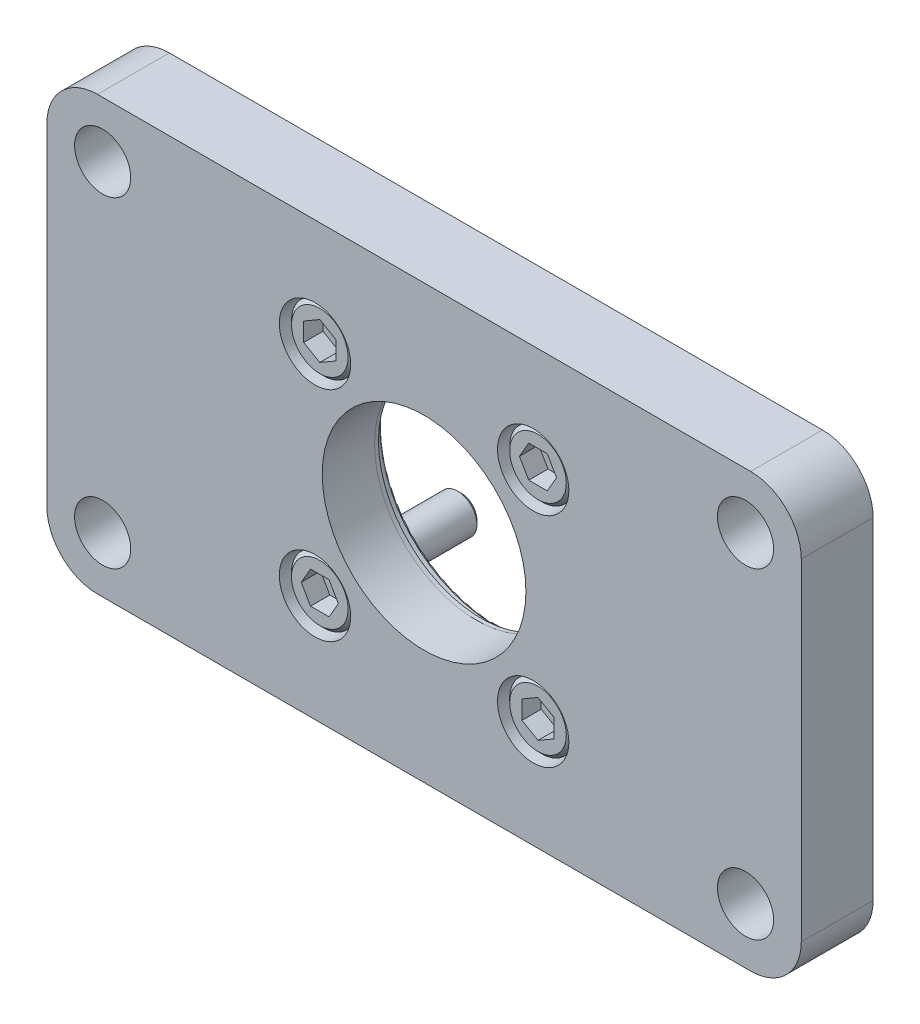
ISO-10303-21;
HEADER;
FILE_DESCRIPTION(('STEP AP214'),'2;1');
FILE_NAME('part.step','',(''),(''),'','','');
FILE_SCHEMA(('AUTOMOTIVE_DESIGN { 1 0 10303 214 1 1 1 1 }'));
ENDSEC;
DATA;
#1=APPLICATION_CONTEXT('core data for automotive mechanical design processes');
#2=APPLICATION_PROTOCOL_DEFINITION('international standard','automotive_design',2000,#1);
#3=PRODUCT_CONTEXT('',#1,'mechanical');
#4=PRODUCT('Part','Part','',(#3));
#5=PRODUCT_RELATED_PRODUCT_CATEGORY('part','',(#4));
#6=PRODUCT_DEFINITION_FORMATION('','',#4);
#7=PRODUCT_DEFINITION_CONTEXT('part definition',#1,'design');
#8=PRODUCT_DEFINITION('design','',#6,#7);
#9=PRODUCT_DEFINITION_SHAPE('','',#8);
#10=(LENGTH_UNIT() NAMED_UNIT(*) SI_UNIT(.MILLI.,.METRE.));
#11=(NAMED_UNIT(*) PLANE_ANGLE_UNIT() SI_UNIT($,.RADIAN.));
#12=(NAMED_UNIT(*) SI_UNIT($,.STERADIAN.) SOLID_ANGLE_UNIT());
#13=UNCERTAINTY_MEASURE_WITH_UNIT(LENGTH_MEASURE(1.E-05),#10,'distance_accuracy_value','');
#14=(GEOMETRIC_REPRESENTATION_CONTEXT(3) GLOBAL_UNCERTAINTY_ASSIGNED_CONTEXT((#13)) GLOBAL_UNIT_ASSIGNED_CONTEXT((#10,
#11,#12)) REPRESENTATION_CONTEXT('',''));
#15=CARTESIAN_POINT('',(0.,0.,0.));
#16=DIRECTION('',(0.,0.,1.));
#17=DIRECTION('',(1.,0.,0.));
#18=AXIS2_PLACEMENT_3D('',#15,#16,#17);
#19=CARTESIAN_POINT('',(-16.9705627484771,16.9705627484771,4.42600000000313));
#20=DIRECTION('',(0.,0.,1.));
#21=DIRECTION('',(1.,0.,0.));
#22=AXIS2_PLACEMENT_3D('',#19,#20,#21);
#23=CYLINDRICAL_SURFACE('',#22,5.);
#24=CARTESIAN_POINT('',(-16.9705627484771,16.9705627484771,3.426));
#25=DIRECTION('',(0.,0.,1.));
#26=DIRECTION('',(1.,0.,0.));
#27=AXIS2_PLACEMENT_3D('',#24,#25,#26);
#28=CIRCLE('',#27,5.);
#29=CARTESIAN_POINT('',(-11.9705627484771,16.9705627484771,3.426));
#30=VERTEX_POINT('',#29);
#31=EDGE_CURVE('E295',#30,#30,#28,.T.);
#32=ORIENTED_EDGE('',*,*,#31,.T.);
#33=EDGE_LOOP('',(#32));
#34=FACE_BOUND('',#33,.T.);
#35=CARTESIAN_POINT('',(-16.9705627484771,16.9705627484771,9.82600000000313));
#36=DIRECTION('',(0.,0.,-1.));
#37=DIRECTION('',(0.,1.,0.));
#38=AXIS2_PLACEMENT_3D('',#35,#36,#37);
#39=CIRCLE('',#38,5.);
#40=CARTESIAN_POINT('',(-16.9705627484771,21.9705627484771,9.82600000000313));
#41=VERTEX_POINT('',#40);
#42=EDGE_CURVE('E369',#41,#41,#39,.T.);
#43=ORIENTED_EDGE('',*,*,#42,.T.);
#44=EDGE_LOOP('',(#43));
#45=FACE_BOUND('',#44,.T.);
#46=ADVANCED_FACE('F17',(#34,#45),#23,.T.);
#47=CARTESIAN_POINT('',(-15.5271870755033,-19.470562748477,7.42600000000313));
#48=DIRECTION('',(0.,0.,1.));
#49=DIRECTION('',(1.,0.,0.));
#50=AXIS2_PLACEMENT_3D('',#47,#48,#49);
#51=PLANE('',#50);
#52=DIRECTION('',(1.,0.,0.));
#53=VECTOR('',#52,1.);
#54=CARTESIAN_POINT('',(-18.4139384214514,-19.4705627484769,7.42600000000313));
#55=LINE('',#54,#53);
#56=CARTESIAN_POINT('',(-18.4139384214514,-19.4705627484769,7.42600000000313));
#57=VERTEX_POINT('',#56);
#58=CARTESIAN_POINT('',(-15.5271870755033,-19.470562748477,7.42600000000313));
#59=VERTEX_POINT('',#58);
#60=EDGE_CURVE('E207',#57,#59,#55,.T.);
#61=ORIENTED_EDGE('',*,*,#60,.T.);
#62=DIRECTION('',(0.500000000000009,0.866025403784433,0.));
#63=VECTOR('',#62,1.);
#64=CARTESIAN_POINT('',(-15.5271870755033,-19.470562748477,7.42600000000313));
#65=LINE('',#64,#63);
#66=CARTESIAN_POINT('',(-14.0838114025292,-16.970562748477,7.42600000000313));
#67=VERTEX_POINT('',#66);
#68=EDGE_CURVE('E717',#59,#67,#65,.T.);
#69=ORIENTED_EDGE('',*,*,#68,.T.);
#70=DIRECTION('',(-0.499999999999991,0.866025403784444,0.));
#71=VECTOR('',#70,1.);
#72=CARTESIAN_POINT('',(-14.0838114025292,-16.970562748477,7.42600000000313));
#73=LINE('',#72,#71);
#74=CARTESIAN_POINT('',(-15.5271870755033,-14.470562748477,7.42600000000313));
#75=VERTEX_POINT('',#74);
#76=EDGE_CURVE('E720',#67,#75,#73,.T.);
#77=ORIENTED_EDGE('',*,*,#76,.T.);
#78=DIRECTION('',(-1.,0.,0.));
#79=VECTOR('',#78,1.);
#80=CARTESIAN_POINT('',(-15.5271870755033,-14.470562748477,7.42600000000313));
#81=LINE('',#80,#79);
#82=CARTESIAN_POINT('',(-18.4139384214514,-14.4705627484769,7.42600000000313));
#83=VERTEX_POINT('',#82);
#84=EDGE_CURVE('E723',#75,#83,#81,.T.);
#85=ORIENTED_EDGE('',*,*,#84,.T.);
#86=DIRECTION('',(-0.500000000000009,-0.866025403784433,0.));
#87=VECTOR('',#86,1.);
#88=CARTESIAN_POINT('',(-18.4139384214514,-14.4705627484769,7.42600000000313));
#89=LINE('',#88,#87);
#90=CARTESIAN_POINT('',(-19.8573140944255,-16.9705627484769,7.42600000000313));
#91=VERTEX_POINT('',#90);
#92=EDGE_CURVE('E725',#83,#91,#89,.T.);
#93=ORIENTED_EDGE('',*,*,#92,.T.);
#94=DIRECTION('',(0.499999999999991,-0.866025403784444,0.));
#95=VECTOR('',#94,1.);
#96=CARTESIAN_POINT('',(-19.8573140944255,-16.9705627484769,7.42600000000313));
#97=LINE('',#96,#95);
#98=EDGE_CURVE('E232',#91,#57,#97,.T.);
#99=ORIENTED_EDGE('',*,*,#98,.T.);
#100=EDGE_LOOP('',(#61,#69,#77,#85,#93,#99));
#101=FACE_BOUND('',#100,.T.);
#102=ADVANCED_FACE('F729',(#101),#51,.T.);
#103=CARTESIAN_POINT('',(19.470562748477,-15.5271870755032,7.42600000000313));
#104=DIRECTION('',(0.,0.,1.));
#105=DIRECTION('',(0.,1.,0.));
#106=AXIS2_PLACEMENT_3D('',#103,#104,#105);
#107=PLANE('',#106);
#108=DIRECTION('',(0.,1.,0.));
#109=VECTOR('',#108,1.);
#110=CARTESIAN_POINT('',(19.470562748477,-18.4139384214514,7.42600000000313));
#111=LINE('',#110,#109);
#112=CARTESIAN_POINT('',(19.470562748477,-18.4139384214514,7.42600000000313));
#113=VERTEX_POINT('',#112);
#114=CARTESIAN_POINT('',(19.470562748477,-15.5271870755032,7.42600000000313));
#115=VERTEX_POINT('',#114);
#116=EDGE_CURVE('E561',#113,#115,#111,.T.);
#117=ORIENTED_EDGE('',*,*,#116,.T.);
#118=DIRECTION('',(-0.866025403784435,0.500000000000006,0.));
#119=VECTOR('',#118,1.);
#120=CARTESIAN_POINT('',(19.470562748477,-15.5271870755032,7.42600000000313));
#121=LINE('',#120,#119);
#122=CARTESIAN_POINT('',(16.9705627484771,-14.0838114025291,7.42600000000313));
#123=VERTEX_POINT('',#122);
#124=EDGE_CURVE('E564',#115,#123,#121,.T.);
#125=ORIENTED_EDGE('',*,*,#124,.T.);
#126=DIRECTION('',(-0.866025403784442,-0.499999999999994,0.));
#127=VECTOR('',#126,1.);
#128=CARTESIAN_POINT('',(16.9705627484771,-14.0838114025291,7.42600000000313));
#129=LINE('',#128,#127);
#130=CARTESIAN_POINT('',(14.470562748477,-15.5271870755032,7.42600000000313));
#131=VERTEX_POINT('',#130);
#132=EDGE_CURVE('E568',#123,#131,#129,.T.);
#133=ORIENTED_EDGE('',*,*,#132,.T.);
#134=DIRECTION('',(0.,-1.,0.));
#135=VECTOR('',#134,1.);
#136=CARTESIAN_POINT('',(14.470562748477,-15.5271870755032,7.42600000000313));
#137=LINE('',#136,#135);
#138=CARTESIAN_POINT('',(14.470562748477,-18.4139384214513,7.42600000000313));
#139=VERTEX_POINT('',#138);
#140=EDGE_CURVE('E571',#131,#139,#137,.T.);
#141=ORIENTED_EDGE('',*,*,#140,.T.);
#142=DIRECTION('',(0.866025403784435,-0.500000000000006,0.));
#143=VECTOR('',#142,1.);
#144=CARTESIAN_POINT('',(14.470562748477,-18.4139384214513,7.42600000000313));
#145=LINE('',#144,#143);
#146=CARTESIAN_POINT('',(16.970562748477,-19.8573140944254,7.42600000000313));
#147=VERTEX_POINT('',#146);
#148=EDGE_CURVE('E574',#139,#147,#145,.T.);
#149=ORIENTED_EDGE('',*,*,#148,.T.);
#150=DIRECTION('',(0.866025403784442,0.499999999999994,0.));
#151=VECTOR('',#150,1.);
#152=CARTESIAN_POINT('',(16.970562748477,-19.8573140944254,7.42600000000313));
#153=LINE('',#152,#151);
#154=EDGE_CURVE('E577',#147,#113,#153,.T.);
#155=ORIENTED_EDGE('',*,*,#154,.T.);
#156=EDGE_LOOP('',(#117,#125,#133,#141,#149,#155));
#157=FACE_BOUND('',#156,.T.);
#158=ADVANCED_FACE('F759',(#157),#107,.T.);
#159=CARTESIAN_POINT('',(15.5271870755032,19.4705627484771,7.42600000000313));
#160=DIRECTION('',(0.,0.,1.));
#161=DIRECTION('',(-1.,0.,0.));
#162=AXIS2_PLACEMENT_3D('',#159,#160,#161);
#163=PLANE('',#162);
#164=DIRECTION('',(-1.,0.,0.));
#165=VECTOR('',#164,1.);
#166=CARTESIAN_POINT('',(18.4139384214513,19.4705627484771,7.42600000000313));
#167=LINE('',#166,#165);
#168=CARTESIAN_POINT('',(18.4139384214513,19.4705627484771,7.42600000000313));
#169=VERTEX_POINT('',#168);
#170=CARTESIAN_POINT('',(15.5271870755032,19.4705627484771,7.42600000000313));
#171=VERTEX_POINT('',#170);
#172=EDGE_CURVE('E647',#169,#171,#167,.T.);
#173=ORIENTED_EDGE('',*,*,#172,.T.);
#174=DIRECTION('',(-0.5,-0.866025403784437,0.));
#175=VECTOR('',#174,1.);
#176=CARTESIAN_POINT('',(15.5271870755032,19.4705627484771,7.42600000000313));
#177=LINE('',#176,#175);
#178=CARTESIAN_POINT('',(14.0838114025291,16.9705627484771,7.42600000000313));
#179=VERTEX_POINT('',#178);
#180=EDGE_CURVE('E650',#171,#179,#177,.T.);
#181=ORIENTED_EDGE('',*,*,#180,.T.);
#182=DIRECTION('',(0.5,-0.86602540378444,0.));
#183=VECTOR('',#182,1.);
#184=CARTESIAN_POINT('',(14.0838114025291,16.9705627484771,7.42600000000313));
#185=LINE('',#184,#183);
#186=CARTESIAN_POINT('',(15.5271870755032,14.4705627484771,7.42600000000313));
#187=VERTEX_POINT('',#186);
#188=EDGE_CURVE('E654',#179,#187,#185,.T.);
#189=ORIENTED_EDGE('',*,*,#188,.T.);
#190=DIRECTION('',(1.,0.,0.));
#191=VECTOR('',#190,1.);
#192=CARTESIAN_POINT('',(15.5271870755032,14.4705627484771,7.42600000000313));
#193=LINE('',#192,#191);
#194=CARTESIAN_POINT('',(18.4139384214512,14.4705627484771,7.42600000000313));
#195=VERTEX_POINT('',#194);
#196=EDGE_CURVE('E657',#187,#195,#193,.T.);
#197=ORIENTED_EDGE('',*,*,#196,.T.);
#198=DIRECTION('',(0.5,0.866025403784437,0.));
#199=VECTOR('',#198,1.);
#200=CARTESIAN_POINT('',(18.4139384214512,14.4705627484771,7.42600000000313));
#201=LINE('',#200,#199);
#202=CARTESIAN_POINT('',(19.8573140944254,16.9705627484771,7.42600000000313));
#203=VERTEX_POINT('',#202);
#204=EDGE_CURVE('E660',#195,#203,#201,.T.);
#205=ORIENTED_EDGE('',*,*,#204,.T.);
#206=DIRECTION('',(-0.5,0.86602540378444,0.));
#207=VECTOR('',#206,1.);
#208=CARTESIAN_POINT('',(19.8573140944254,16.9705627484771,7.42600000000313));
#209=LINE('',#208,#207);
#210=EDGE_CURVE('E663',#203,#169,#209,.T.);
#211=ORIENTED_EDGE('',*,*,#210,.T.);
#212=EDGE_LOOP('',(#173,#181,#189,#197,#205,#211));
#213=FACE_BOUND('',#212,.T.);
#214=ADVANCED_FACE('F913',(#213),#163,.T.);
#215=CARTESIAN_POINT('',(-15.5271870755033,-19.470562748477,7.42600000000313));
#216=DIRECTION('',(0.866025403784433,-0.500000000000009,0.));
#217=DIRECTION('',(0.500000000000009,0.866025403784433,0.));
#218=AXIS2_PLACEMENT_3D('',#215,#216,#217);
#219=PLANE('',#218);
#220=DIRECTION('',(0.500000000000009,0.866025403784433,0.));
#221=VECTOR('',#220,1.);
#222=CARTESIAN_POINT('',(-15.5271870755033,-19.470562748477,10.4260000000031));
#223=LINE('',#222,#221);
#224=CARTESIAN_POINT('',(-15.5271870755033,-19.470562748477,10.4260000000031));
#225=VERTEX_POINT('',#224);
#226=CARTESIAN_POINT('',(-14.0838114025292,-16.970562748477,10.4260000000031));
#227=VERTEX_POINT('',#226);
#228=EDGE_CURVE('E227',#225,#227,#223,.T.);
#229=ORIENTED_EDGE('',*,*,#228,.T.);
#230=DIRECTION('',(0.,0.,1.));
#231=VECTOR('',#230,1.);
#232=CARTESIAN_POINT('',(-14.0838114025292,-16.970562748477,7.42600000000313));
#233=LINE('',#232,#231);
#234=EDGE_CURVE('E246',#67,#227,#233,.T.);
#235=ORIENTED_EDGE('',*,*,#234,.F.);
#236=ORIENTED_EDGE('',*,*,#68,.F.);
#237=DIRECTION('',(0.,0.,1.));
#238=VECTOR('',#237,1.);
#239=CARTESIAN_POINT('',(-15.5271870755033,-19.470562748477,7.42600000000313));
#240=LINE('',#239,#238);
#241=EDGE_CURVE('E248',#59,#225,#240,.T.);
#242=ORIENTED_EDGE('',*,*,#241,.T.);
#243=EDGE_LOOP('',(#229,#235,#236,#242));
#244=FACE_BOUND('',#243,.T.);
#245=ADVANCED_FACE('F733',(#244),#219,.F.);
#246=CARTESIAN_POINT('',(-14.0838114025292,-16.970562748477,7.42600000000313));
#247=DIRECTION('',(0.866025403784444,0.499999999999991,0.));
#248=DIRECTION('',(-0.499999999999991,0.866025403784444,0.));
#249=AXIS2_PLACEMENT_3D('',#246,#247,#248);
#250=PLANE('',#249);
#251=DIRECTION('',(-0.499999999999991,0.866025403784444,0.));
#252=VECTOR('',#251,1.);
#253=CARTESIAN_POINT('',(-14.0838114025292,-16.970562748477,10.4260000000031));
#254=LINE('',#253,#252);
#255=CARTESIAN_POINT('',(-15.5271870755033,-14.470562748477,10.4260000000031));
#256=VERTEX_POINT('',#255);
#257=EDGE_CURVE('E229',#227,#256,#254,.T.);
#258=ORIENTED_EDGE('',*,*,#257,.T.);
#259=DIRECTION('',(0.,0.,1.));
#260=VECTOR('',#259,1.);
#261=CARTESIAN_POINT('',(-15.5271870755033,-14.470562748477,7.42600000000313));
#262=LINE('',#261,#260);
#263=EDGE_CURVE('E244',#75,#256,#262,.T.);
#264=ORIENTED_EDGE('',*,*,#263,.F.);
#265=ORIENTED_EDGE('',*,*,#76,.F.);
#266=ORIENTED_EDGE('',*,*,#234,.T.);
#267=EDGE_LOOP('',(#258,#264,#265,#266));
#268=FACE_BOUND('',#267,.T.);
#269=ADVANCED_FACE('F735',(#268),#250,.F.);
#270=CARTESIAN_POINT('',(-15.5271870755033,-14.470562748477,7.42600000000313));
#271=DIRECTION('',(0.,1.,0.));
#272=DIRECTION('',(-1.,0.,0.));
#273=AXIS2_PLACEMENT_3D('',#270,#271,#272);
#274=PLANE('',#273);
#275=DIRECTION('',(-1.,0.,0.));
#276=VECTOR('',#275,1.);
#277=CARTESIAN_POINT('',(-15.5271870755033,-14.470562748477,10.4260000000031));
#278=LINE('',#277,#276);
#279=CARTESIAN_POINT('',(-18.4139384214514,-14.4705627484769,10.4260000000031));
#280=VERTEX_POINT('',#279);
#281=EDGE_CURVE('E237',#256,#280,#278,.T.);
#282=ORIENTED_EDGE('',*,*,#281,.T.);
#283=DIRECTION('',(0.,0.,1.));
#284=VECTOR('',#283,1.);
#285=CARTESIAN_POINT('',(-18.4139384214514,-14.4705627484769,7.42600000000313));
#286=LINE('',#285,#284);
#287=EDGE_CURVE('E242',#83,#280,#286,.T.);
#288=ORIENTED_EDGE('',*,*,#287,.F.);
#289=ORIENTED_EDGE('',*,*,#84,.F.);
#290=ORIENTED_EDGE('',*,*,#263,.T.);
#291=EDGE_LOOP('',(#282,#288,#289,#290));
#292=FACE_BOUND('',#291,.T.);
#293=ADVANCED_FACE('F739',(#292),#274,.F.);
#294=CARTESIAN_POINT('',(-18.4139384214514,-14.4705627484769,7.42600000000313));
#295=DIRECTION('',(-0.866025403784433,0.500000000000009,0.));
#296=DIRECTION('',(-0.500000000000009,-0.866025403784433,0.));
#297=AXIS2_PLACEMENT_3D('',#294,#295,#296);
#298=PLANE('',#297);
#299=DIRECTION('',(-0.500000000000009,-0.866025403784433,0.));
#300=VECTOR('',#299,1.);
#301=CARTESIAN_POINT('',(-18.4139384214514,-14.4705627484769,10.4260000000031));
#302=LINE('',#301,#300);
#303=CARTESIAN_POINT('',(-19.8573140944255,-16.9705627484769,10.4260000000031));
#304=VERTEX_POINT('',#303);
#305=EDGE_CURVE('E220',#280,#304,#302,.T.);
#306=ORIENTED_EDGE('',*,*,#305,.T.);
#307=DIRECTION('',(0.,0.,1.));
#308=VECTOR('',#307,1.);
#309=CARTESIAN_POINT('',(-19.8573140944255,-16.9705627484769,7.42600000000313));
#310=LINE('',#309,#308);
#311=EDGE_CURVE('E212',#91,#304,#310,.T.);
#312=ORIENTED_EDGE('',*,*,#311,.F.);
#313=ORIENTED_EDGE('',*,*,#92,.F.);
#314=ORIENTED_EDGE('',*,*,#287,.T.);
#315=EDGE_LOOP('',(#306,#312,#313,#314));
#316=FACE_BOUND('',#315,.T.);
#317=ADVANCED_FACE('F741',(#316),#298,.F.);
#318=CARTESIAN_POINT('',(-19.8573140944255,-16.9705627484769,7.42600000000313));
#319=DIRECTION('',(-0.866025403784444,-0.499999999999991,0.));
#320=DIRECTION('',(0.499999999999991,-0.866025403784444,0.));
#321=AXIS2_PLACEMENT_3D('',#318,#319,#320);
#322=PLANE('',#321);
#323=DIRECTION('',(0.499999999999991,-0.866025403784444,0.));
#324=VECTOR('',#323,1.);
#325=CARTESIAN_POINT('',(-19.8573140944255,-16.9705627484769,10.4260000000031));
#326=LINE('',#325,#324);
#327=CARTESIAN_POINT('',(-18.4139384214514,-19.4705627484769,10.4260000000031));
#328=VERTEX_POINT('',#327);
#329=EDGE_CURVE('E215',#304,#328,#326,.T.);
#330=ORIENTED_EDGE('',*,*,#329,.T.);
#331=DIRECTION('',(0.,0.,1.));
#332=VECTOR('',#331,1.);
#333=CARTESIAN_POINT('',(-18.4139384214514,-19.4705627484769,7.42600000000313));
#334=LINE('',#333,#332);
#335=EDGE_CURVE('E200',#57,#328,#334,.T.);
#336=ORIENTED_EDGE('',*,*,#335,.F.);
#337=ORIENTED_EDGE('',*,*,#98,.F.);
#338=ORIENTED_EDGE('',*,*,#311,.T.);
#339=EDGE_LOOP('',(#330,#336,#337,#338));
#340=FACE_BOUND('',#339,.T.);
#341=ADVANCED_FACE('F216',(#340),#322,.F.);
#342=CARTESIAN_POINT('',(-18.4139384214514,-19.4705627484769,7.42600000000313));
#343=DIRECTION('',(0.,-1.,0.));
#344=DIRECTION('',(1.,0.,0.));
#345=AXIS2_PLACEMENT_3D('',#342,#343,#344);
#346=PLANE('',#345);
#347=DIRECTION('',(1.,0.,0.));
#348=VECTOR('',#347,1.);
#349=CARTESIAN_POINT('',(-18.4139384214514,-19.4705627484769,10.4260000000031));
#350=LINE('',#349,#348);
#351=EDGE_CURVE('E204',#328,#225,#350,.T.);
#352=ORIENTED_EDGE('',*,*,#351,.T.);
#353=ORIENTED_EDGE('',*,*,#241,.F.);
#354=ORIENTED_EDGE('',*,*,#60,.F.);
#355=ORIENTED_EDGE('',*,*,#335,.T.);
#356=EDGE_LOOP('',(#352,#353,#354,#355));
#357=FACE_BOUND('',#356,.T.);
#358=ADVANCED_FACE('F202',(#357),#346,.F.);
#359=CARTESIAN_POINT('',(19.470562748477,-15.5271870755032,7.42600000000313));
#360=DIRECTION('',(0.500000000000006,0.866025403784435,0.));
#361=DIRECTION('',(-0.866025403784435,0.500000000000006,0.));
#362=AXIS2_PLACEMENT_3D('',#359,#360,#361);
#363=PLANE('',#362);
#364=DIRECTION('',(-0.866025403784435,0.500000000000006,0.));
#365=VECTOR('',#364,1.);
#366=CARTESIAN_POINT('',(19.470562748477,-15.5271870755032,10.4260000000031));
#367=LINE('',#366,#365);
#368=CARTESIAN_POINT('',(19.470562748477,-15.5271870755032,10.4260000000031));
#369=VERTEX_POINT('',#368);
#370=CARTESIAN_POINT('',(16.9705627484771,-14.0838114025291,10.4260000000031));
#371=VERTEX_POINT('',#370);
#372=EDGE_CURVE('E583',#369,#371,#367,.T.);
#373=ORIENTED_EDGE('',*,*,#372,.T.);
#374=DIRECTION('',(0.,0.,1.));
#375=VECTOR('',#374,1.);
#376=CARTESIAN_POINT('',(16.9705627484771,-14.0838114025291,7.42600000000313));
#377=LINE('',#376,#375);
#378=EDGE_CURVE('E607',#123,#371,#377,.T.);
#379=ORIENTED_EDGE('',*,*,#378,.F.);
#380=ORIENTED_EDGE('',*,*,#124,.F.);
#381=DIRECTION('',(0.,0.,1.));
#382=VECTOR('',#381,1.);
#383=CARTESIAN_POINT('',(19.470562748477,-15.5271870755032,7.42600000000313));
#384=LINE('',#383,#382);
#385=EDGE_CURVE('E580',#115,#369,#384,.T.);
#386=ORIENTED_EDGE('',*,*,#385,.T.);
#387=EDGE_LOOP('',(#373,#379,#380,#386));
#388=FACE_BOUND('',#387,.T.);
#389=ADVANCED_FACE('F931',(#388),#363,.F.);
#390=CARTESIAN_POINT('',(16.9705627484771,-14.0838114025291,7.42600000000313));
#391=DIRECTION('',(-0.499999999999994,0.866025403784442,0.));
#392=DIRECTION('',(-0.866025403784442,-0.499999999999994,0.));
#393=AXIS2_PLACEMENT_3D('',#390,#391,#392);
#394=PLANE('',#393);
#395=DIRECTION('',(-0.866025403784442,-0.499999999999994,0.));
#396=VECTOR('',#395,1.);
#397=CARTESIAN_POINT('',(16.9705627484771,-14.0838114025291,10.4260000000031));
#398=LINE('',#397,#396);
#399=CARTESIAN_POINT('',(14.470562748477,-15.5271870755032,10.4260000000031));
#400=VERTEX_POINT('',#399);
#401=EDGE_CURVE('E587',#371,#400,#398,.T.);
#402=ORIENTED_EDGE('',*,*,#401,.T.);
#403=DIRECTION('',(0.,0.,1.));
#404=VECTOR('',#403,1.);
#405=CARTESIAN_POINT('',(14.470562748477,-15.5271870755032,7.42600000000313));
#406=LINE('',#405,#404);
#407=EDGE_CURVE('E605',#131,#400,#406,.T.);
#408=ORIENTED_EDGE('',*,*,#407,.F.);
#409=ORIENTED_EDGE('',*,*,#132,.F.);
#410=ORIENTED_EDGE('',*,*,#378,.T.);
#411=EDGE_LOOP('',(#402,#408,#409,#410));
#412=FACE_BOUND('',#411,.T.);
#413=ADVANCED_FACE('F927',(#412),#394,.F.);
#414=CARTESIAN_POINT('',(14.470562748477,-15.5271870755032,7.42600000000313));
#415=DIRECTION('',(-1.,0.,0.));
#416=DIRECTION('',(0.,-1.,0.));
#417=AXIS2_PLACEMENT_3D('',#414,#415,#416);
#418=PLANE('',#417);
#419=DIRECTION('',(0.,-1.,0.));
#420=VECTOR('',#419,1.);
#421=CARTESIAN_POINT('',(14.470562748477,-15.5271870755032,10.4260000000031));
#422=LINE('',#421,#420);
#423=CARTESIAN_POINT('',(14.470562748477,-18.4139384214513,10.4260000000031));
#424=VERTEX_POINT('',#423);
#425=EDGE_CURVE('E590',#400,#424,#422,.T.);
#426=ORIENTED_EDGE('',*,*,#425,.T.);
#427=DIRECTION('',(0.,0.,1.));
#428=VECTOR('',#427,1.);
#429=CARTESIAN_POINT('',(14.470562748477,-18.4139384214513,7.42600000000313));
#430=LINE('',#429,#428);
#431=EDGE_CURVE('E603',#139,#424,#430,.T.);
#432=ORIENTED_EDGE('',*,*,#431,.F.);
#433=ORIENTED_EDGE('',*,*,#140,.F.);
#434=ORIENTED_EDGE('',*,*,#407,.T.);
#435=EDGE_LOOP('',(#426,#432,#433,#434));
#436=FACE_BOUND('',#435,.T.);
#437=ADVANCED_FACE('F923',(#436),#418,.F.);
#438=CARTESIAN_POINT('',(14.470562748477,-18.4139384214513,7.42600000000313));
#439=DIRECTION('',(-0.500000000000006,-0.866025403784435,0.));
#440=DIRECTION('',(0.866025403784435,-0.500000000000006,0.));
#441=AXIS2_PLACEMENT_3D('',#438,#439,#440);
#442=PLANE('',#441);
#443=DIRECTION('',(0.866025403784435,-0.500000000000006,0.));
#444=VECTOR('',#443,1.);
#445=CARTESIAN_POINT('',(14.470562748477,-18.4139384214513,10.4260000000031));
#446=LINE('',#445,#444);
#447=CARTESIAN_POINT('',(16.970562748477,-19.8573140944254,10.4260000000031));
#448=VERTEX_POINT('',#447);
#449=EDGE_CURVE('E593',#424,#448,#446,.T.);
#450=ORIENTED_EDGE('',*,*,#449,.T.);
#451=DIRECTION('',(0.,0.,1.));
#452=VECTOR('',#451,1.);
#453=CARTESIAN_POINT('',(16.970562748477,-19.8573140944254,7.42600000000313));
#454=LINE('',#453,#452);
#455=EDGE_CURVE('E601',#147,#448,#454,.T.);
#456=ORIENTED_EDGE('',*,*,#455,.F.);
#457=ORIENTED_EDGE('',*,*,#148,.F.);
#458=ORIENTED_EDGE('',*,*,#431,.T.);
#459=EDGE_LOOP('',(#450,#456,#457,#458));
#460=FACE_BOUND('',#459,.T.);
#461=ADVANCED_FACE('F919',(#460),#442,.F.);
#462=CARTESIAN_POINT('',(16.970562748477,-19.8573140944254,7.42600000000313));
#463=DIRECTION('',(0.499999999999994,-0.866025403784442,0.));
#464=DIRECTION('',(0.866025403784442,0.499999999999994,0.));
#465=AXIS2_PLACEMENT_3D('',#462,#463,#464);
#466=PLANE('',#465);
#467=DIRECTION('',(0.866025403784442,0.499999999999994,0.));
#468=VECTOR('',#467,1.);
#469=CARTESIAN_POINT('',(16.970562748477,-19.8573140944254,10.4260000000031));
#470=LINE('',#469,#468);
#471=CARTESIAN_POINT('',(19.470562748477,-18.4139384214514,10.4260000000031));
#472=VERTEX_POINT('',#471);
#473=EDGE_CURVE('E565',#448,#472,#470,.T.);
#474=ORIENTED_EDGE('',*,*,#473,.T.);
#475=DIRECTION('',(0.,0.,1.));
#476=VECTOR('',#475,1.);
#477=CARTESIAN_POINT('',(19.470562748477,-18.4139384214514,7.42600000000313));
#478=LINE('',#477,#476);
#479=EDGE_CURVE('E598',#113,#472,#478,.T.);
#480=ORIENTED_EDGE('',*,*,#479,.F.);
#481=ORIENTED_EDGE('',*,*,#154,.F.);
#482=ORIENTED_EDGE('',*,*,#455,.T.);
#483=EDGE_LOOP('',(#474,#480,#481,#482));
#484=FACE_BOUND('',#483,.T.);
#485=ADVANCED_FACE('F915',(#484),#466,.F.);
#486=CARTESIAN_POINT('',(19.470562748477,-18.4139384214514,7.42600000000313));
#487=DIRECTION('',(1.,0.,0.));
#488=DIRECTION('',(0.,1.,0.));
#489=AXIS2_PLACEMENT_3D('',#486,#487,#488);
#490=PLANE('',#489);
#491=DIRECTION('',(0.,1.,0.));
#492=VECTOR('',#491,1.);
#493=CARTESIAN_POINT('',(19.470562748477,-18.4139384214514,10.4260000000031));
#494=LINE('',#493,#492);
#495=EDGE_CURVE('E581',#472,#369,#494,.T.);
#496=ORIENTED_EDGE('',*,*,#495,.T.);
#497=ORIENTED_EDGE('',*,*,#385,.F.);
#498=ORIENTED_EDGE('',*,*,#116,.F.);
#499=ORIENTED_EDGE('',*,*,#479,.T.);
#500=EDGE_LOOP('',(#496,#497,#498,#499));
#501=FACE_BOUND('',#500,.T.);
#502=ADVANCED_FACE('F918',(#501),#490,.F.);
#503=CARTESIAN_POINT('',(15.5271870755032,19.4705627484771,7.42600000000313));
#504=DIRECTION('',(-0.866025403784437,0.5,0.));
#505=DIRECTION('',(-0.5,-0.866025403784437,0.));
#506=AXIS2_PLACEMENT_3D('',#503,#504,#505);
#507=PLANE('',#506);
#508=DIRECTION('',(-0.5,-0.866025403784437,0.));
#509=VECTOR('',#508,1.);
#510=CARTESIAN_POINT('',(15.5271870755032,19.4705627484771,10.4260000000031));
#511=LINE('',#510,#509);
#512=CARTESIAN_POINT('',(15.5271870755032,19.4705627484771,10.4260000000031));
#513=VERTEX_POINT('',#512);
#514=CARTESIAN_POINT('',(14.0838114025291,16.9705627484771,10.4260000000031));
#515=VERTEX_POINT('',#514);
#516=EDGE_CURVE('E668',#513,#515,#511,.T.);
#517=ORIENTED_EDGE('',*,*,#516,.T.);
#518=DIRECTION('',(0.,0.,1.));
#519=VECTOR('',#518,1.);
#520=CARTESIAN_POINT('',(14.0838114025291,16.9705627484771,7.42600000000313));
#521=LINE('',#520,#519);
#522=EDGE_CURVE('E691',#179,#515,#521,.T.);
#523=ORIENTED_EDGE('',*,*,#522,.F.);
#524=ORIENTED_EDGE('',*,*,#180,.F.);
#525=DIRECTION('',(0.,0.,1.));
#526=VECTOR('',#525,1.);
#527=CARTESIAN_POINT('',(15.5271870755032,19.4705627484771,7.42600000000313));
#528=LINE('',#527,#526);
#529=EDGE_CURVE('E666',#171,#513,#528,.T.);
#530=ORIENTED_EDGE('',*,*,#529,.T.);
#531=EDGE_LOOP('',(#517,#523,#524,#530));
#532=FACE_BOUND('',#531,.T.);
#533=ADVANCED_FACE('F937',(#532),#507,.F.);
#534=CARTESIAN_POINT('',(14.0838114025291,16.9705627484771,7.42600000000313));
#535=DIRECTION('',(-0.86602540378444,-0.5,0.));
#536=DIRECTION('',(0.5,-0.86602540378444,0.));
#537=AXIS2_PLACEMENT_3D('',#534,#535,#536);
#538=PLANE('',#537);
#539=DIRECTION('',(0.5,-0.86602540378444,0.));
#540=VECTOR('',#539,1.);
#541=CARTESIAN_POINT('',(14.0838114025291,16.9705627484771,10.4260000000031));
#542=LINE('',#541,#540);
#543=CARTESIAN_POINT('',(15.5271870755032,14.4705627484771,10.4260000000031));
#544=VERTEX_POINT('',#543);
#545=EDGE_CURVE('E671',#515,#544,#542,.T.);
#546=ORIENTED_EDGE('',*,*,#545,.T.);
#547=DIRECTION('',(0.,0.,1.));
#548=VECTOR('',#547,1.);
#549=CARTESIAN_POINT('',(15.5271870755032,14.4705627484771,7.42600000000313));
#550=LINE('',#549,#548);
#551=EDGE_CURVE('E689',#187,#544,#550,.T.);
#552=ORIENTED_EDGE('',*,*,#551,.F.);
#553=ORIENTED_EDGE('',*,*,#188,.F.);
#554=ORIENTED_EDGE('',*,*,#522,.T.);
#555=EDGE_LOOP('',(#546,#552,#553,#554));
#556=FACE_BOUND('',#555,.T.);
#557=ADVANCED_FACE('F1016',(#556),#538,.F.);
#558=CARTESIAN_POINT('',(15.5271870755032,14.4705627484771,7.42600000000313));
#559=DIRECTION('',(0.,-1.,0.));
#560=DIRECTION('',(1.,0.,0.));
#561=AXIS2_PLACEMENT_3D('',#558,#559,#560);
#562=PLANE('',#561);
#563=DIRECTION('',(1.,0.,0.));
#564=VECTOR('',#563,1.);
#565=CARTESIAN_POINT('',(15.5271870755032,14.4705627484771,10.4260000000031));
#566=LINE('',#565,#564);
#567=CARTESIAN_POINT('',(18.4139384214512,14.4705627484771,10.4260000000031));
#568=VERTEX_POINT('',#567);
#569=EDGE_CURVE('E674',#544,#568,#566,.T.);
#570=ORIENTED_EDGE('',*,*,#569,.T.);
#571=DIRECTION('',(0.,0.,1.));
#572=VECTOR('',#571,1.);
#573=CARTESIAN_POINT('',(18.4139384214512,14.4705627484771,7.42600000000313));
#574=LINE('',#573,#572);
#575=EDGE_CURVE('E687',#195,#568,#574,.T.);
#576=ORIENTED_EDGE('',*,*,#575,.F.);
#577=ORIENTED_EDGE('',*,*,#196,.F.);
#578=ORIENTED_EDGE('',*,*,#551,.T.);
#579=EDGE_LOOP('',(#570,#576,#577,#578));
#580=FACE_BOUND('',#579,.T.);
#581=ADVANCED_FACE('F1012',(#580),#562,.F.);
#582=CARTESIAN_POINT('',(18.4139384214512,14.4705627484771,7.42600000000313));
#583=DIRECTION('',(0.866025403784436,-0.5,0.));
#584=DIRECTION('',(0.5,0.866025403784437,0.));
#585=AXIS2_PLACEMENT_3D('',#582,#583,#584);
#586=PLANE('',#585);
#587=DIRECTION('',(0.5,0.866025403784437,0.));
#588=VECTOR('',#587,1.);
#589=CARTESIAN_POINT('',(18.4139384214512,14.4705627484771,10.4260000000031));
#590=LINE('',#589,#588);
#591=CARTESIAN_POINT('',(19.8573140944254,16.9705627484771,10.4260000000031));
#592=VERTEX_POINT('',#591);
#593=EDGE_CURVE('E677',#568,#592,#590,.T.);
#594=ORIENTED_EDGE('',*,*,#593,.T.);
#595=DIRECTION('',(0.,0.,1.));
#596=VECTOR('',#595,1.);
#597=CARTESIAN_POINT('',(19.8573140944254,16.9705627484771,7.42600000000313));
#598=LINE('',#597,#596);
#599=EDGE_CURVE('E685',#203,#592,#598,.T.);
#600=ORIENTED_EDGE('',*,*,#599,.F.);
#601=ORIENTED_EDGE('',*,*,#204,.F.);
#602=ORIENTED_EDGE('',*,*,#575,.T.);
#603=EDGE_LOOP('',(#594,#600,#601,#602));
#604=FACE_BOUND('',#603,.T.);
#605=ADVANCED_FACE('F1008',(#604),#586,.F.);
#606=CARTESIAN_POINT('',(19.8573140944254,16.9705627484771,7.42600000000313));
#607=DIRECTION('',(0.86602540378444,0.5,0.));
#608=DIRECTION('',(-0.5,0.86602540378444,0.));
#609=AXIS2_PLACEMENT_3D('',#606,#607,#608);
#610=PLANE('',#609);
#611=DIRECTION('',(-0.5,0.86602540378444,0.));
#612=VECTOR('',#611,1.);
#613=CARTESIAN_POINT('',(19.8573140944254,16.9705627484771,10.4260000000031));
#614=LINE('',#613,#612);
#615=CARTESIAN_POINT('',(18.4139384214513,19.4705627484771,10.4260000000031));
#616=VERTEX_POINT('',#615);
#617=EDGE_CURVE('E651',#592,#616,#614,.T.);
#618=ORIENTED_EDGE('',*,*,#617,.T.);
#619=DIRECTION('',(0.,0.,1.));
#620=VECTOR('',#619,1.);
#621=CARTESIAN_POINT('',(18.4139384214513,19.4705627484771,7.42600000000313));
#622=LINE('',#621,#620);
#623=EDGE_CURVE('E682',#169,#616,#622,.T.);
#624=ORIENTED_EDGE('',*,*,#623,.F.);
#625=ORIENTED_EDGE('',*,*,#210,.F.);
#626=ORIENTED_EDGE('',*,*,#599,.T.);
#627=EDGE_LOOP('',(#618,#624,#625,#626));
#628=FACE_BOUND('',#627,.T.);
#629=ADVANCED_FACE('F1004',(#628),#610,.F.);
#630=CARTESIAN_POINT('',(18.4139384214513,19.4705627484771,7.42600000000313));
#631=DIRECTION('',(0.,1.,0.));
#632=DIRECTION('',(-1.,0.,0.));
#633=AXIS2_PLACEMENT_3D('',#630,#631,#632);
#634=PLANE('',#633);
#635=DIRECTION('',(-1.,0.,0.));
#636=VECTOR('',#635,1.);
#637=CARTESIAN_POINT('',(18.4139384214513,19.4705627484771,10.4260000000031));
#638=LINE('',#637,#636);
#639=EDGE_CURVE('E273',#616,#513,#638,.T.);
#640=ORIENTED_EDGE('',*,*,#639,.T.);
#641=ORIENTED_EDGE('',*,*,#529,.F.);
#642=ORIENTED_EDGE('',*,*,#172,.F.);
#643=ORIENTED_EDGE('',*,*,#623,.T.);
#644=EDGE_LOOP('',(#640,#641,#642,#643));
#645=FACE_BOUND('',#644,.T.);
#646=ADVANCED_FACE('F1007',(#645),#634,.F.);
#647=CARTESIAN_POINT('',(-16.9705627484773,-12.570562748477,10.4260000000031));
#648=DIRECTION('',(0.,0.,1.));
#649=DIRECTION('',(1.,0.,0.));
#650=AXIS2_PLACEMENT_3D('',#647,#648,#649);
#651=PLANE('',#650);
#652=ORIENTED_EDGE('',*,*,#351,.F.);
#653=ORIENTED_EDGE('',*,*,#329,.F.);
#654=ORIENTED_EDGE('',*,*,#305,.F.);
#655=ORIENTED_EDGE('',*,*,#281,.F.);
#656=ORIENTED_EDGE('',*,*,#257,.F.);
#657=ORIENTED_EDGE('',*,*,#228,.F.);
#658=EDGE_LOOP('',(#652,#653,#654,#655,#656,#657));
#659=FACE_BOUND('',#658,.T.);
#660=CARTESIAN_POINT('',(-16.9705627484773,-16.9705627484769,10.4260000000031));
#661=DIRECTION('',(0.,0.,-1.));
#662=DIRECTION('',(-1.,0.,0.));
#663=AXIS2_PLACEMENT_3D('',#660,#661,#662);
#664=CIRCLE('',#663,4.4);
#665=CARTESIAN_POINT('',(-21.3705627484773,-16.9705627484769,10.4260000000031));
#666=VERTEX_POINT('',#665);
#667=EDGE_CURVE('E255',#666,#666,#664,.T.);
#668=ORIENTED_EDGE('',*,*,#667,.F.);
#669=EDGE_LOOP('',(#668));
#670=FACE_BOUND('',#669,.T.);
#671=ADVANCED_FACE('F223',(#659,#670),#651,.T.);
#672=CARTESIAN_POINT('',(12.570562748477,-16.9705627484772,10.4260000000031));
#673=DIRECTION('',(0.,0.,1.));
#674=DIRECTION('',(0.,1.,0.));
#675=AXIS2_PLACEMENT_3D('',#672,#673,#674);
#676=PLANE('',#675);
#677=ORIENTED_EDGE('',*,*,#495,.F.);
#678=ORIENTED_EDGE('',*,*,#473,.F.);
#679=ORIENTED_EDGE('',*,*,#449,.F.);
#680=ORIENTED_EDGE('',*,*,#425,.F.);
#681=ORIENTED_EDGE('',*,*,#401,.F.);
#682=ORIENTED_EDGE('',*,*,#372,.F.);
#683=EDGE_LOOP('',(#677,#678,#679,#680,#681,#682));
#684=FACE_BOUND('',#683,.T.);
#685=CARTESIAN_POINT('',(16.970562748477,-16.9705627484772,10.4260000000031));
#686=DIRECTION('',(0.,0.,-1.));
#687=DIRECTION('',(0.,-1.,0.));
#688=AXIS2_PLACEMENT_3D('',#685,#686,#687);
#689=CIRCLE('',#688,4.4);
#690=CARTESIAN_POINT('',(16.970562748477,-21.3705627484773,10.4260000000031));
#691=VERTEX_POINT('',#690);
#692=EDGE_CURVE('E616',#691,#691,#689,.T.);
#693=ORIENTED_EDGE('',*,*,#692,.F.);
#694=EDGE_LOOP('',(#693));
#695=FACE_BOUND('',#694,.T.);
#696=ADVANCED_FACE('F946',(#684,#695),#676,.T.);
#697=CARTESIAN_POINT('',(16.9705627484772,12.5705627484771,10.4260000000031));
#698=DIRECTION('',(0.,0.,1.));
#699=DIRECTION('',(-1.,0.,0.));
#700=AXIS2_PLACEMENT_3D('',#697,#698,#699);
#701=PLANE('',#700);
#702=ORIENTED_EDGE('',*,*,#639,.F.);
#703=ORIENTED_EDGE('',*,*,#617,.F.);
#704=ORIENTED_EDGE('',*,*,#593,.F.);
#705=ORIENTED_EDGE('',*,*,#569,.F.);
#706=ORIENTED_EDGE('',*,*,#545,.F.);
#707=ORIENTED_EDGE('',*,*,#516,.F.);
#708=EDGE_LOOP('',(#702,#703,#704,#705,#706,#707));
#709=FACE_BOUND('',#708,.T.);
#710=CARTESIAN_POINT('',(16.9705627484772,16.9705627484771,10.4260000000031));
#711=DIRECTION('',(0.,0.,-1.));
#712=DIRECTION('',(1.,0.,0.));
#713=AXIS2_PLACEMENT_3D('',#710,#711,#712);
#714=CIRCLE('',#713,4.4);
#715=CARTESIAN_POINT('',(21.3705627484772,16.9705627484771,10.4260000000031));
#716=VERTEX_POINT('',#715);
#717=EDGE_CURVE('E700',#716,#716,#714,.T.);
#718=ORIENTED_EDGE('',*,*,#717,.F.);
#719=EDGE_LOOP('',(#718));
#720=FACE_BOUND('',#719,.T.);
#721=ADVANCED_FACE('F835',(#709,#720),#701,.T.);
#722=CARTESIAN_POINT('',(0.,0.,3.048));
#723=DIRECTION('',(0.,0.,-1.));
#724=DIRECTION('',(-1.,0.,0.));
#725=AXIS2_PLACEMENT_3D('',#722,#723,#724);
#726=CYLINDRICAL_SURFACE('',#725,17.3863);
#727=CARTESIAN_POINT('',(0.,0.,3.048));
#728=DIRECTION('',(0.,0.,-1.));
#729=DIRECTION('',(-1.,0.,0.));
#730=AXIS2_PLACEMENT_3D('',#727,#728,#729);
#731=CIRCLE('',#730,17.3863);
#732=CARTESIAN_POINT('',(-17.3863,0.,3.048));
#733=VERTEX_POINT('',#732);
#734=EDGE_CURVE('E291',#733,#733,#731,.F.);
#735=ORIENTED_EDGE('',*,*,#734,.F.);
#736=EDGE_LOOP('',(#735));
#737=FACE_BOUND('',#736,.T.);
#738=CARTESIAN_POINT('',(0.,0.,2.298));
#739=DIRECTION('',(0.,0.,1.));
#740=DIRECTION('',(1.,0.,0.));
#741=AXIS2_PLACEMENT_3D('',#738,#739,#740);
#742=CIRCLE('',#741,17.3863);
#743=CARTESIAN_POINT('',(17.3863,0.,2.298));
#744=VERTEX_POINT('',#743);
#745=EDGE_CURVE('E385',#744,#744,#742,.T.);
#746=ORIENTED_EDGE('',*,*,#745,.T.);
#747=EDGE_LOOP('',(#746));
#748=FACE_BOUND('',#747,.T.);
#749=ADVANCED_FACE('F782',(#737,#748),#726,.T.);
#750=CARTESIAN_POINT('',(0.,0.,3.048));
#751=DIRECTION('',(0.,0.,-1.));
#752=DIRECTION('',(-1.,0.,0.));
#753=AXIS2_PLACEMENT_3D('',#750,#751,#752);
#754=PLANE('',#753);
#755=ORIENTED_EDGE('',*,*,#734,.T.);
#756=EDGE_LOOP('',(#755));
#757=FACE_BOUND('',#756,.T.);
#758=CARTESIAN_POINT('',(0.,0.,3.048));
#759=DIRECTION('',(0.,0.,-1.));
#760=DIRECTION('',(-1.,0.,0.));
#761=AXIS2_PLACEMENT_3D('',#758,#759,#760);
#762=CIRCLE('',#761,17.76924995);
#763=CARTESIAN_POINT('',(-17.76924995,0.,3.048));
#764=VERTEX_POINT('',#763);
#765=EDGE_CURVE('E410',#764,#764,#762,.T.);
#766=ORIENTED_EDGE('',*,*,#765,.T.);
#767=EDGE_LOOP('',(#766));
#768=FACE_BOUND('',#767,.T.);
#769=ADVANCED_FACE('F781',(#757,#768),#754,.T.);
#770=CARTESIAN_POINT('',(-16.9705627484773,-16.9705627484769,-11.5739999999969));
#771=DIRECTION('',(0.,0.,-1.));
#772=DIRECTION('',(-1.,0.,0.));
#773=AXIS2_PLACEMENT_3D('',#770,#771,#772);
#774=PLANE('',#773);
#775=CARTESIAN_POINT('',(-16.9705627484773,-16.9705627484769,-11.5739999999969));
#776=DIRECTION('',(0.,0.,-1.));
#777=DIRECTION('',(-1.,0.,0.));
#778=AXIS2_PLACEMENT_3D('',#775,#776,#777);
#779=CIRCLE('',#778,2.4455);
#780=CARTESIAN_POINT('',(-19.4160627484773,-16.9705627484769,-11.5739999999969));
#781=VERTEX_POINT('',#780);
#782=EDGE_CURVE('E252',#781,#781,#779,.T.);
#783=ORIENTED_EDGE('',*,*,#782,.T.);
#784=EDGE_LOOP('',(#783));
#785=FACE_BOUND('',#784,.T.);
#786=ADVANCED_FACE('F1036',(#785),#774,.T.);
#787=CARTESIAN_POINT('',(16.9705627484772,16.9705627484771,-11.5739999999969));
#788=DIRECTION('',(0.,0.,-1.));
#789=DIRECTION('',(1.,0.,0.));
#790=AXIS2_PLACEMENT_3D('',#787,#788,#789);
#791=PLANE('',#790);
#792=CARTESIAN_POINT('',(16.9705627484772,16.9705627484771,-11.5739999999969));
#793=DIRECTION('',(0.,0.,-1.));
#794=DIRECTION('',(1.,0.,0.));
#795=AXIS2_PLACEMENT_3D('',#792,#793,#794);
#796=CIRCLE('',#795,2.4455);
#797=CARTESIAN_POINT('',(19.4160627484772,16.9705627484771,-11.5739999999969));
#798=VERTEX_POINT('',#797);
#799=EDGE_CURVE('E697',#798,#798,#796,.T.);
#800=ORIENTED_EDGE('',*,*,#799,.T.);
#801=EDGE_LOOP('',(#800));
#802=FACE_BOUND('',#801,.T.);
#803=ADVANCED_FACE('F836',(#802),#791,.T.);
#804=CARTESIAN_POINT('',(16.970562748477,-16.9705627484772,-11.5739999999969));
#805=DIRECTION('',(0.,0.,-1.));
#806=DIRECTION('',(0.,-1.,0.));
#807=AXIS2_PLACEMENT_3D('',#804,#805,#806);
#808=PLANE('',#807);
#809=CARTESIAN_POINT('',(16.970562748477,-16.9705627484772,-11.5739999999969));
#810=DIRECTION('',(0.,0.,-1.));
#811=DIRECTION('',(0.,-1.,0.));
#812=AXIS2_PLACEMENT_3D('',#809,#810,#811);
#813=CIRCLE('',#812,2.4455);
#814=CARTESIAN_POINT('',(16.970562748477,-19.4160627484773,-11.5739999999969));
#815=VERTEX_POINT('',#814);
#816=EDGE_CURVE('E613',#815,#815,#813,.T.);
#817=ORIENTED_EDGE('',*,*,#816,.T.);
#818=EDGE_LOOP('',(#817));
#819=FACE_BOUND('',#818,.T.);
#820=ADVANCED_FACE('F825',(#819),#808,.T.);
#821=CARTESIAN_POINT('',(-16.9705627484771,16.9705627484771,-11.5739999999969));
#822=DIRECTION('',(0.,0.,-1.));
#823=DIRECTION('',(0.,1.,0.));
#824=AXIS2_PLACEMENT_3D('',#821,#822,#823);
#825=PLANE('',#824);
#826=CARTESIAN_POINT('',(-16.9705627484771,16.9705627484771,-11.5739999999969));
#827=DIRECTION('',(0.,0.,-1.));
#828=DIRECTION('',(0.,1.,0.));
#829=AXIS2_PLACEMENT_3D('',#826,#827,#828);
#830=CIRCLE('',#829,2.4455);
#831=CARTESIAN_POINT('',(-16.9705627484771,19.4160627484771,-11.5739999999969));
#832=VERTEX_POINT('',#831);
#833=EDGE_CURVE('E363',#832,#832,#830,.T.);
#834=ORIENTED_EDGE('',*,*,#833,.T.);
#835=EDGE_LOOP('',(#834));
#836=FACE_BOUND('',#835,.T.);
#837=ADVANCED_FACE('F808',(#836),#825,.T.);
#838=CARTESIAN_POINT('',(-16.9705627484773,-16.9705627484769,9.82600000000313));
#839=DIRECTION('',(0.,0.,-1.));
#840=DIRECTION('',(-1.,0.,0.));
#841=AXIS2_PLACEMENT_3D('',#838,#839,#840);
#842=CONICAL_SURFACE('',#841,5.,0.785398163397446);
#843=ORIENTED_EDGE('',*,*,#667,.T.);
#844=EDGE_LOOP('',(#843));
#845=FACE_BOUND('',#844,.T.);
#846=CARTESIAN_POINT('',(-16.9705627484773,-16.9705627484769,9.82600000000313));
#847=DIRECTION('',(0.,0.,-1.));
#848=DIRECTION('',(-1.,0.,0.));
#849=AXIS2_PLACEMENT_3D('',#846,#847,#848);
#850=CIRCLE('',#849,5.);
#851=CARTESIAN_POINT('',(-21.9705627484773,-16.9705627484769,9.82600000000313));
#852=VERTEX_POINT('',#851);
#853=EDGE_CURVE('E258',#852,#852,#850,.T.);
#854=ORIENTED_EDGE('',*,*,#853,.F.);
#855=EDGE_LOOP('',(#854));
#856=FACE_BOUND('',#855,.T.);
#857=ADVANCED_FACE('F824',(#845,#856),#842,.T.);
#858=CARTESIAN_POINT('',(16.970562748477,-16.9705627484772,9.82600000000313));
#859=DIRECTION('',(0.,0.,-1.));
#860=DIRECTION('',(0.,-1.,0.));
#861=AXIS2_PLACEMENT_3D('',#858,#859,#860);
#862=CONICAL_SURFACE('',#861,5.,0.785398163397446);
#863=ORIENTED_EDGE('',*,*,#692,.T.);
#864=EDGE_LOOP('',(#863));
#865=FACE_BOUND('',#864,.T.);
#866=CARTESIAN_POINT('',(16.970562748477,-16.9705627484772,9.82600000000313));
#867=DIRECTION('',(0.,0.,-1.));
#868=DIRECTION('',(0.,-1.,0.));
#869=AXIS2_PLACEMENT_3D('',#866,#867,#868);
#870=CIRCLE('',#869,5.);
#871=CARTESIAN_POINT('',(16.970562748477,-21.9705627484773,9.82600000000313));
#872=VERTEX_POINT('',#871);
#873=EDGE_CURVE('E619',#872,#872,#870,.T.);
#874=ORIENTED_EDGE('',*,*,#873,.F.);
#875=EDGE_LOOP('',(#874));
#876=FACE_BOUND('',#875,.T.);
#877=ADVANCED_FACE('F832',(#865,#876),#862,.T.);
#878=CARTESIAN_POINT('',(16.9705627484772,16.9705627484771,9.82600000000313));
#879=DIRECTION('',(0.,0.,-1.));
#880=DIRECTION('',(1.,0.,0.));
#881=AXIS2_PLACEMENT_3D('',#878,#879,#880);
#882=CONICAL_SURFACE('',#881,5.,0.785398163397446);
#883=ORIENTED_EDGE('',*,*,#717,.T.);
#884=EDGE_LOOP('',(#883));
#885=FACE_BOUND('',#884,.T.);
#886=CARTESIAN_POINT('',(16.9705627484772,16.9705627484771,9.82600000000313));
#887=DIRECTION('',(0.,0.,-1.));
#888=DIRECTION('',(1.,0.,0.));
#889=AXIS2_PLACEMENT_3D('',#886,#887,#888);
#890=CIRCLE('',#889,5.);
#891=CARTESIAN_POINT('',(21.9705627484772,16.9705627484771,9.82600000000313));
#892=VERTEX_POINT('',#891);
#893=EDGE_CURVE('E703',#892,#892,#890,.T.);
#894=ORIENTED_EDGE('',*,*,#893,.F.);
#895=EDGE_LOOP('',(#894));
#896=FACE_BOUND('',#895,.T.);
#897=ADVANCED_FACE('F816',(#885,#896),#882,.T.);
#898=CARTESIAN_POINT('',(0.,0.,2.298));
#899=DIRECTION('',(0.,0.,1.));
#900=DIRECTION('',(1.,0.,0.));
#901=AXIS2_PLACEMENT_3D('',#898,#899,#900);
#902=PLANE('',#901);
#903=ORIENTED_EDGE('',*,*,#745,.F.);
#904=EDGE_LOOP('',(#903));
#905=FACE_BOUND('',#904,.T.);
#906=CARTESIAN_POINT('',(0.,0.,2.298));
#907=DIRECTION('',(0.,0.,1.));
#908=DIRECTION('',(1.,0.,0.));
#909=AXIS2_PLACEMENT_3D('',#906,#907,#908);
#910=CIRCLE('',#909,15.9766);
#911=CARTESIAN_POINT('',(15.9766,0.,2.298));
#912=VERTEX_POINT('',#911);
#913=EDGE_CURVE('E555',#912,#912,#910,.T.);
#914=ORIENTED_EDGE('',*,*,#913,.T.);
#915=EDGE_LOOP('',(#914));
#916=FACE_BOUND('',#915,.T.);
#917=ADVANCED_FACE('F903',(#905,#916),#902,.F.);
#918=CARTESIAN_POINT('',(0.,0.,3.048));
#919=DIRECTION('',(0.,0.,-1.));
#920=DIRECTION('',(-1.,0.,0.));
#921=AXIS2_PLACEMENT_3D('',#918,#919,#920);
#922=CYLINDRICAL_SURFACE('',#921,17.76924995);
#923=CARTESIAN_POINT('',(0.,0.,0.381));
#924=DIRECTION('',(0.,0.,-1.));
#925=DIRECTION('',(-1.,0.,0.));
#926=AXIS2_PLACEMENT_3D('',#923,#924,#925);
#927=CIRCLE('',#926,17.76924995);
#928=CARTESIAN_POINT('',(-17.76924995,0.,0.381));
#929=VERTEX_POINT('',#928);
#930=EDGE_CURVE('E519',#929,#929,#927,.T.);
#931=ORIENTED_EDGE('',*,*,#930,.T.);
#932=EDGE_LOOP('',(#931));
#933=FACE_BOUND('',#932,.T.);
#934=ORIENTED_EDGE('',*,*,#765,.F.);
#935=EDGE_LOOP('',(#934));
#936=FACE_BOUND('',#935,.T.);
#937=ADVANCED_FACE('F906',(#933,#936),#922,.F.);
#938=CARTESIAN_POINT('',(-24.,0.,5.842));
#939=DIRECTION('',(0.,0.,1.));
#940=DIRECTION('',(1.,0.,0.));
#941=AXIS2_PLACEMENT_3D('',#938,#939,#940);
#942=PLANE('',#941);
#943=CARTESIAN_POINT('',(-24.,0.,5.842));
#944=DIRECTION('',(0.,0.,1.));
#945=DIRECTION('',(1.,0.,0.));
#946=AXIS2_PLACEMENT_3D('',#943,#944,#945);
#947=CIRCLE('',#946,5.3975);
#948=CARTESIAN_POINT('',(-18.6025,0.,5.842));
#949=VERTEX_POINT('',#948);
#950=EDGE_CURVE('E426',#949,#949,#947,.T.);
#951=ORIENTED_EDGE('',*,*,#950,.F.);
#952=EDGE_LOOP('',(#951));
#953=FACE_BOUND('',#952,.T.);
#954=ADVANCED_FACE('F1204',(#953),#942,.F.);
#955=CARTESIAN_POINT('',(0.,-24.,5.842));
#956=DIRECTION('',(0.,0.,1.));
#957=DIRECTION('',(1.,0.,0.));
#958=AXIS2_PLACEMENT_3D('',#955,#956,#957);
#959=PLANE('',#958);
#960=CARTESIAN_POINT('',(0.,-24.,5.842));
#961=DIRECTION('',(0.,0.,1.));
#962=DIRECTION('',(1.,0.,0.));
#963=AXIS2_PLACEMENT_3D('',#960,#961,#962);
#964=CIRCLE('',#963,5.3975);
#965=CARTESIAN_POINT('',(5.3975,-24.,5.842));
#966=VERTEX_POINT('',#965);
#967=EDGE_CURVE('E420',#966,#966,#964,.T.);
#968=ORIENTED_EDGE('',*,*,#967,.F.);
#969=EDGE_LOOP('',(#968));
#970=FACE_BOUND('',#969,.T.);
#971=ADVANCED_FACE('F1196',(#970),#959,.F.);
#972=CARTESIAN_POINT('',(0.,24.,5.842));
#973=DIRECTION('',(0.,0.,1.));
#974=DIRECTION('',(1.,0.,0.));
#975=AXIS2_PLACEMENT_3D('',#972,#973,#974);
#976=PLANE('',#975);
#977=CARTESIAN_POINT('',(0.,24.,5.842));
#978=DIRECTION('',(0.,0.,1.));
#979=DIRECTION('',(1.,0.,0.));
#980=AXIS2_PLACEMENT_3D('',#977,#978,#979);
#981=CIRCLE('',#980,5.3975);
#982=CARTESIAN_POINT('',(5.3975,24.,5.842));
#983=VERTEX_POINT('',#982);
#984=EDGE_CURVE('E414',#983,#983,#981,.T.);
#985=ORIENTED_EDGE('',*,*,#984,.F.);
#986=EDGE_LOOP('',(#985));
#987=FACE_BOUND('',#986,.T.);
#988=ADVANCED_FACE('F1187',(#987),#976,.F.);
#989=CARTESIAN_POINT('',(24.,0.,5.842));
#990=DIRECTION('',(0.,0.,1.));
#991=DIRECTION('',(1.,0.,0.));
#992=AXIS2_PLACEMENT_3D('',#989,#990,#991);
#993=PLANE('',#992);
#994=CARTESIAN_POINT('',(24.,0.,5.842));
#995=DIRECTION('',(0.,0.,1.));
#996=DIRECTION('',(1.,0.,0.));
#997=AXIS2_PLACEMENT_3D('',#994,#995,#996);
#998=CIRCLE('',#997,5.3975);
#999=CARTESIAN_POINT('',(29.3975,0.,5.842));
#1000=VERTEX_POINT('',#999);
#1001=EDGE_CURVE('E407',#1000,#1000,#998,.T.);
#1002=ORIENTED_EDGE('',*,*,#1001,.F.);
#1003=EDGE_LOOP('',(#1002));
#1004=FACE_BOUND('',#1003,.T.);
#1005=ADVANCED_FACE('F1184',(#1004),#993,.F.);
#1006=CARTESIAN_POINT('',(-16.9705627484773,-16.9705627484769,-11.5739999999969));
#1007=DIRECTION('',(0.,0.,1.));
#1008=DIRECTION('',(1.,0.,0.));
#1009=AXIS2_PLACEMENT_3D('',#1006,#1007,#1008);
#1010=CONICAL_SURFACE('',#1009,2.4455,0.785398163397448);
#1011=CARTESIAN_POINT('',(-16.9705627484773,-16.9705627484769,-11.0194999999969));
#1012=DIRECTION('',(0.,0.,-1.));
#1013=DIRECTION('',(-1.,0.,0.));
#1014=AXIS2_PLACEMENT_3D('',#1011,#1012,#1013);
#1015=CIRCLE('',#1014,3.);
#1016=CARTESIAN_POINT('',(-19.9705627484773,-16.9705627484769,-11.0194999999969));
#1017=VERTEX_POINT('',#1016);
#1018=EDGE_CURVE('E211',#1017,#1017,#1015,.T.);
#1019=ORIENTED_EDGE('',*,*,#1018,.T.);
#1020=EDGE_LOOP('',(#1019));
#1021=FACE_BOUND('',#1020,.T.);
#1022=ORIENTED_EDGE('',*,*,#782,.F.);
#1023=EDGE_LOOP('',(#1022));
#1024=FACE_BOUND('',#1023,.T.);
#1025=ADVANCED_FACE('F1032',(#1021,#1024),#1010,.T.);
#1026=CARTESIAN_POINT('',(16.9705627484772,16.9705627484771,-11.5739999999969));
#1027=DIRECTION('',(0.,0.,1.));
#1028=DIRECTION('',(-1.,0.,0.));
#1029=AXIS2_PLACEMENT_3D('',#1026,#1027,#1028);
#1030=CONICAL_SURFACE('',#1029,2.4455,0.785398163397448);
#1031=CARTESIAN_POINT('',(16.9705627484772,16.9705627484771,-11.0194999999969));
#1032=DIRECTION('',(0.,0.,-1.));
#1033=DIRECTION('',(1.,0.,0.));
#1034=AXIS2_PLACEMENT_3D('',#1031,#1032,#1033);
#1035=CIRCLE('',#1034,3.);
#1036=CARTESIAN_POINT('',(19.9705627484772,16.9705627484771,-11.0194999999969));
#1037=VERTEX_POINT('',#1036);
#1038=EDGE_CURVE('E684',#1037,#1037,#1035,.T.);
#1039=ORIENTED_EDGE('',*,*,#1038,.T.);
#1040=EDGE_LOOP('',(#1039));
#1041=FACE_BOUND('',#1040,.T.);
#1042=ORIENTED_EDGE('',*,*,#799,.F.);
#1043=EDGE_LOOP('',(#1042));
#1044=FACE_BOUND('',#1043,.T.);
#1045=ADVANCED_FACE('F817',(#1041,#1044),#1030,.T.);
#1046=CARTESIAN_POINT('',(16.970562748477,-16.9705627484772,-11.5739999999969));
#1047=DIRECTION('',(0.,0.,1.));
#1048=DIRECTION('',(0.,1.,0.));
#1049=AXIS2_PLACEMENT_3D('',#1046,#1047,#1048);
#1050=CONICAL_SURFACE('',#1049,2.4455,0.785398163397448);
#1051=CARTESIAN_POINT('',(16.970562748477,-16.9705627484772,-11.0194999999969));
#1052=DIRECTION('',(0.,0.,-1.));
#1053=DIRECTION('',(0.,-1.,0.));
#1054=AXIS2_PLACEMENT_3D('',#1051,#1052,#1053);
#1055=CIRCLE('',#1054,3.);
#1056=CARTESIAN_POINT('',(16.970562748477,-19.9705627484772,-11.0194999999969));
#1057=VERTEX_POINT('',#1056);
#1058=EDGE_CURVE('E600',#1057,#1057,#1055,.T.);
#1059=ORIENTED_EDGE('',*,*,#1058,.T.);
#1060=EDGE_LOOP('',(#1059));
#1061=FACE_BOUND('',#1060,.T.);
#1062=ORIENTED_EDGE('',*,*,#816,.F.);
#1063=EDGE_LOOP('',(#1062));
#1064=FACE_BOUND('',#1063,.T.);
#1065=ADVANCED_FACE('F806',(#1061,#1064),#1050,.T.);
#1066=CARTESIAN_POINT('',(-16.9705627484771,16.9705627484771,-11.5739999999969));
#1067=DIRECTION('',(0.,0.,1.));
#1068=DIRECTION('',(0.,-1.,0.));
#1069=AXIS2_PLACEMENT_3D('',#1066,#1067,#1068);
#1070=CONICAL_SURFACE('',#1069,2.4455,0.785398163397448);
#1071=CARTESIAN_POINT('',(-16.9705627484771,16.9705627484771,-11.0194999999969));
#1072=DIRECTION('',(0.,0.,-1.));
#1073=DIRECTION('',(0.,1.,0.));
#1074=AXIS2_PLACEMENT_3D('',#1071,#1072,#1073);
#1075=CIRCLE('',#1074,3.);
#1076=CARTESIAN_POINT('',(-16.9705627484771,19.9705627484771,-11.0194999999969));
#1077=VERTEX_POINT('',#1076);
#1078=EDGE_CURVE('E347',#1077,#1077,#1075,.T.);
#1079=ORIENTED_EDGE('',*,*,#1078,.T.);
#1080=EDGE_LOOP('',(#1079));
#1081=FACE_BOUND('',#1080,.T.);
#1082=ORIENTED_EDGE('',*,*,#833,.F.);
#1083=EDGE_LOOP('',(#1082));
#1084=FACE_BOUND('',#1083,.T.);
#1085=ADVANCED_FACE('F772',(#1081,#1084),#1070,.T.);
#1086=CARTESIAN_POINT('',(-16.9705627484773,-16.9705627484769,4.42600000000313));
#1087=DIRECTION('',(0.,0.,-1.));
#1088=DIRECTION('',(-1.,0.,0.));
#1089=AXIS2_PLACEMENT_3D('',#1086,#1087,#1088);
#1090=CYLINDRICAL_SURFACE('',#1089,5.);
#1091=ORIENTED_EDGE('',*,*,#853,.T.);
#1092=EDGE_LOOP('',(#1091));
#1093=FACE_BOUND('',#1092,.T.);
#1094=CARTESIAN_POINT('',(-16.9705627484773,-16.9705627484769,3.426));
#1095=DIRECTION('',(0.,0.,1.));
#1096=DIRECTION('',(0.,1.,0.));
#1097=AXIS2_PLACEMENT_3D('',#1094,#1095,#1096);
#1098=CIRCLE('',#1097,5.);
#1099=CARTESIAN_POINT('',(-16.9705627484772,-11.9705627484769,3.426));
#1100=VERTEX_POINT('',#1099);
#1101=EDGE_CURVE('E549',#1100,#1100,#1098,.T.);
#1102=ORIENTED_EDGE('',*,*,#1101,.T.);
#1103=EDGE_LOOP('',(#1102));
#1104=FACE_BOUND('',#1103,.T.);
#1105=ADVANCED_FACE('F805',(#1093,#1104),#1090,.T.);
#1106=CARTESIAN_POINT('',(16.970562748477,-16.9705627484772,4.42600000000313));
#1107=DIRECTION('',(0.,0.,-1.));
#1108=DIRECTION('',(0.,-1.,0.));
#1109=AXIS2_PLACEMENT_3D('',#1106,#1107,#1108);
#1110=CYLINDRICAL_SURFACE('',#1109,5.);
#1111=ORIENTED_EDGE('',*,*,#873,.T.);
#1112=EDGE_LOOP('',(#1111));
#1113=FACE_BOUND('',#1112,.T.);
#1114=CARTESIAN_POINT('',(16.970562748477,-16.9705627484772,3.426));
#1115=DIRECTION('',(0.,0.,-1.));
#1116=DIRECTION('',(-1.,0.,0.));
#1117=AXIS2_PLACEMENT_3D('',#1114,#1115,#1116);
#1118=CIRCLE('',#1117,5.);
#1119=CARTESIAN_POINT('',(11.970562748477,-16.9705627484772,3.426));
#1120=VERTEX_POINT('',#1119);
#1121=EDGE_CURVE('E534',#1120,#1120,#1118,.T.);
#1122=ORIENTED_EDGE('',*,*,#1121,.F.);
#1123=EDGE_LOOP('',(#1122));
#1124=FACE_BOUND('',#1123,.T.);
#1125=ADVANCED_FACE('F814',(#1113,#1124),#1110,.T.);
#1126=CARTESIAN_POINT('',(16.9705627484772,16.9705627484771,4.42600000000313));
#1127=DIRECTION('',(0.,0.,-1.));
#1128=DIRECTION('',(1.,0.,0.));
#1129=AXIS2_PLACEMENT_3D('',#1126,#1127,#1128);
#1130=CYLINDRICAL_SURFACE('',#1129,5.);
#1131=ORIENTED_EDGE('',*,*,#893,.T.);
#1132=EDGE_LOOP('',(#1131));
#1133=FACE_BOUND('',#1132,.T.);
#1134=CARTESIAN_POINT('',(16.9705627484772,16.9705627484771,3.426));
#1135=DIRECTION('',(0.,0.,1.));
#1136=DIRECTION('',(0.,-1.,0.));
#1137=AXIS2_PLACEMENT_3D('',#1134,#1135,#1136);
#1138=CIRCLE('',#1137,5.);
#1139=CARTESIAN_POINT('',(16.9705627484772,11.9705627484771,3.426));
#1140=VERTEX_POINT('',#1139);
#1141=EDGE_CURVE('E533',#1140,#1140,#1138,.T.);
#1142=ORIENTED_EDGE('',*,*,#1141,.T.);
#1143=EDGE_LOOP('',(#1142));
#1144=FACE_BOUND('',#1143,.T.);
#1145=ADVANCED_FACE('F901',(#1133,#1144),#1130,.T.);
#1146=CARTESIAN_POINT('',(0.,0.,3.048));
#1147=DIRECTION('',(0.,0.,-1.));
#1148=DIRECTION('',(-1.,0.,0.));
#1149=AXIS2_PLACEMENT_3D('',#1146,#1147,#1148);
#1150=CYLINDRICAL_SURFACE('',#1149,15.9766);
#1151=CARTESIAN_POINT('',(0.,0.,3.048));
#1152=DIRECTION('',(0.,0.,-1.));
#1153=DIRECTION('',(-1.,0.,0.));
#1154=AXIS2_PLACEMENT_3D('',#1151,#1152,#1153);
#1155=CIRCLE('',#1154,15.9766);
#1156=CARTESIAN_POINT('',(-15.9766,0.,3.048));
#1157=VERTEX_POINT('',#1156);
#1158=EDGE_CURVE('E550',#1157,#1157,#1155,.F.);
#1159=ORIENTED_EDGE('',*,*,#1158,.T.);
#1160=EDGE_LOOP('',(#1159));
#1161=FACE_BOUND('',#1160,.T.);
#1162=ORIENTED_EDGE('',*,*,#913,.F.);
#1163=EDGE_LOOP('',(#1162));
#1164=FACE_BOUND('',#1163,.T.);
#1165=ADVANCED_FACE('F896',(#1161,#1164),#1150,.F.);
#1166=CARTESIAN_POINT('',(0.,0.,0.381));
#1167=DIRECTION('',(0.,0.,-1.));
#1168=DIRECTION('',(-1.,0.,0.));
#1169=AXIS2_PLACEMENT_3D('',#1166,#1167,#1168);
#1170=TOROIDAL_SURFACE('',#1169,18.15024995,0.381);
#1171=CARTESIAN_POINT('',(0.,0.,0.));
#1172=DIRECTION('',(0.,0.,-1.));
#1173=DIRECTION('',(-1.,0.,0.));
#1174=AXIS2_PLACEMENT_3D('',#1171,#1172,#1173);
#1175=CIRCLE('',#1174,18.15024995);
#1176=CARTESIAN_POINT('',(-18.15024995,0.,0.));
#1177=VERTEX_POINT('',#1176);
#1178=EDGE_CURVE('E524',#1177,#1177,#1175,.F.);
#1179=ORIENTED_EDGE('',*,*,#1178,.F.);
#1180=EDGE_LOOP('',(#1179));
#1181=FACE_BOUND('',#1180,.T.);
#1182=ORIENTED_EDGE('',*,*,#930,.F.);
#1183=EDGE_LOOP('',(#1182));
#1184=FACE_BOUND('',#1183,.T.);
#1185=ADVANCED_FACE('F892',(#1181,#1184),#1170,.T.);
#1186=CARTESIAN_POINT('',(-24.,0.,5.842));
#1187=DIRECTION('',(0.,0.,-1.));
#1188=DIRECTION('',(-1.,0.,0.));
#1189=AXIS2_PLACEMENT_3D('',#1186,#1187,#1188);
#1190=CYLINDRICAL_SURFACE('',#1189,5.3975);
#1191=ORIENTED_EDGE('',*,*,#950,.T.);
#1192=EDGE_LOOP('',(#1191));
#1193=FACE_BOUND('',#1192,.T.);
#1194=CARTESIAN_POINT('',(-24.,0.,0.));
#1195=DIRECTION('',(0.,0.,1.));
#1196=DIRECTION('',(1.,0.,0.));
#1197=AXIS2_PLACEMENT_3D('',#1194,#1195,#1196);
#1198=CIRCLE('',#1197,5.3975);
#1199=CARTESIAN_POINT('',(-18.6025,0.,0.));
#1200=VERTEX_POINT('',#1199);
#1201=EDGE_CURVE('E406',#1200,#1200,#1198,.T.);
#1202=ORIENTED_EDGE('',*,*,#1201,.F.);
#1203=EDGE_LOOP('',(#1202));
#1204=FACE_BOUND('',#1203,.T.);
#1205=ADVANCED_FACE('F895',(#1193,#1204),#1190,.F.);
#1206=CARTESIAN_POINT('',(0.,-24.,5.842));
#1207=DIRECTION('',(0.,0.,-1.));
#1208=DIRECTION('',(-1.,0.,0.));
#1209=AXIS2_PLACEMENT_3D('',#1206,#1207,#1208);
#1210=CYLINDRICAL_SURFACE('',#1209,5.3975);
#1211=ORIENTED_EDGE('',*,*,#967,.T.);
#1212=EDGE_LOOP('',(#1211));
#1213=FACE_BOUND('',#1212,.T.);
#1214=CARTESIAN_POINT('',(0.,-24.,0.));
#1215=DIRECTION('',(0.,0.,1.));
#1216=DIRECTION('',(1.,0.,0.));
#1217=AXIS2_PLACEMENT_3D('',#1214,#1215,#1216);
#1218=CIRCLE('',#1217,5.3975);
#1219=CARTESIAN_POINT('',(5.3975,-24.,0.));
#1220=VERTEX_POINT('',#1219);
#1221=EDGE_CURVE('E423',#1220,#1220,#1218,.T.);
#1222=ORIENTED_EDGE('',*,*,#1221,.F.);
#1223=EDGE_LOOP('',(#1222));
#1224=FACE_BOUND('',#1223,.T.);
#1225=ADVANCED_FACE('F1200',(#1213,#1224),#1210,.F.);
#1226=CARTESIAN_POINT('',(0.,24.,5.842));
#1227=DIRECTION('',(0.,0.,-1.));
#1228=DIRECTION('',(-1.,0.,0.));
#1229=AXIS2_PLACEMENT_3D('',#1226,#1227,#1228);
#1230=CYLINDRICAL_SURFACE('',#1229,5.3975);
#1231=ORIENTED_EDGE('',*,*,#984,.T.);
#1232=EDGE_LOOP('',(#1231));
#1233=FACE_BOUND('',#1232,.T.);
#1234=CARTESIAN_POINT('',(0.,24.,0.));
#1235=DIRECTION('',(0.,0.,1.));
#1236=DIRECTION('',(1.,0.,0.));
#1237=AXIS2_PLACEMENT_3D('',#1234,#1235,#1236);
#1238=CIRCLE('',#1237,5.3975);
#1239=CARTESIAN_POINT('',(5.3975,24.,0.));
#1240=VERTEX_POINT('',#1239);
#1241=EDGE_CURVE('E417',#1240,#1240,#1238,.T.);
#1242=ORIENTED_EDGE('',*,*,#1241,.F.);
#1243=EDGE_LOOP('',(#1242));
#1244=FACE_BOUND('',#1243,.T.);
#1245=ADVANCED_FACE('F1192',(#1233,#1244),#1230,.F.);
#1246=CARTESIAN_POINT('',(24.,0.,5.842));
#1247=DIRECTION('',(0.,0.,-1.));
#1248=DIRECTION('',(-1.,0.,0.));
#1249=AXIS2_PLACEMENT_3D('',#1246,#1247,#1248);
#1250=CYLINDRICAL_SURFACE('',#1249,5.3975);
#1251=ORIENTED_EDGE('',*,*,#1001,.T.);
#1252=EDGE_LOOP('',(#1251));
#1253=FACE_BOUND('',#1252,.T.);
#1254=CARTESIAN_POINT('',(24.,0.,0.));
#1255=DIRECTION('',(0.,0.,1.));
#1256=DIRECTION('',(1.,0.,0.));
#1257=AXIS2_PLACEMENT_3D('',#1254,#1255,#1256);
#1258=CIRCLE('',#1257,5.3975);
#1259=CARTESIAN_POINT('',(29.3975,0.,0.));
#1260=VERTEX_POINT('',#1259);
#1261=EDGE_CURVE('E411',#1260,#1260,#1258,.T.);
#1262=ORIENTED_EDGE('',*,*,#1261,.F.);
#1263=EDGE_LOOP('',(#1262));
#1264=FACE_BOUND('',#1263,.T.);
#1265=ADVANCED_FACE('F1189',(#1253,#1264),#1250,.F.);
#1266=CARTESIAN_POINT('',(-16.9705627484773,-16.9705627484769,4.42600000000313));
#1267=DIRECTION('',(0.,0.,-1.));
#1268=DIRECTION('',(-1.,0.,0.));
#1269=AXIS2_PLACEMENT_3D('',#1266,#1267,#1268);
#1270=CYLINDRICAL_SURFACE('',#1269,3.);
#1271=CARTESIAN_POINT('',(-16.9705627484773,-16.9705627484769,0.));
#1272=DIRECTION('',(0.,0.,-1.));
#1273=DIRECTION('',(-1.,0.,0.));
#1274=AXIS2_PLACEMENT_3D('',#1271,#1272,#1273);
#1275=CIRCLE('',#1274,3.);
#1276=CARTESIAN_POINT('',(-19.9705627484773,-16.9705627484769,0.));
#1277=VERTEX_POINT('',#1276);
#1278=EDGE_CURVE('E287',#1277,#1277,#1275,.T.);
#1279=ORIENTED_EDGE('',*,*,#1278,.T.);
#1280=EDGE_LOOP('',(#1279));
#1281=FACE_BOUND('',#1280,.T.);
#1282=ORIENTED_EDGE('',*,*,#1018,.F.);
#1283=EDGE_LOOP('',(#1282));
#1284=FACE_BOUND('',#1283,.T.);
#1285=ADVANCED_FACE('F1079',(#1281,#1284),#1270,.T.);
#1286=CARTESIAN_POINT('',(16.9705627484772,16.9705627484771,4.42600000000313));
#1287=DIRECTION('',(0.,0.,-1.));
#1288=DIRECTION('',(1.,0.,0.));
#1289=AXIS2_PLACEMENT_3D('',#1286,#1287,#1288);
#1290=CYLINDRICAL_SURFACE('',#1289,3.);
#1291=CARTESIAN_POINT('',(16.9705627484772,16.9705627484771,0.));
#1292=DIRECTION('',(0.,0.,-1.));
#1293=DIRECTION('',(-1.,0.,0.));
#1294=AXIS2_PLACEMENT_3D('',#1291,#1292,#1293);
#1295=CIRCLE('',#1294,3.);
#1296=CARTESIAN_POINT('',(13.9705627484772,16.9705627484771,0.));
#1297=VERTEX_POINT('',#1296);
#1298=EDGE_CURVE('E283',#1297,#1297,#1295,.T.);
#1299=ORIENTED_EDGE('',*,*,#1298,.T.);
#1300=EDGE_LOOP('',(#1299));
#1301=FACE_BOUND('',#1300,.T.);
#1302=ORIENTED_EDGE('',*,*,#1038,.F.);
#1303=EDGE_LOOP('',(#1302));
#1304=FACE_BOUND('',#1303,.T.);
#1305=ADVANCED_FACE('F784',(#1301,#1304),#1290,.T.);
#1306=CARTESIAN_POINT('',(16.970562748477,-16.9705627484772,4.42600000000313));
#1307=DIRECTION('',(0.,0.,-1.));
#1308=DIRECTION('',(0.,-1.,0.));
#1309=AXIS2_PLACEMENT_3D('',#1306,#1307,#1308);
#1310=CYLINDRICAL_SURFACE('',#1309,3.);
#1311=CARTESIAN_POINT('',(16.970562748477,-16.9705627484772,0.));
#1312=DIRECTION('',(0.,0.,-1.));
#1313=DIRECTION('',(-1.,0.,0.));
#1314=AXIS2_PLACEMENT_3D('',#1311,#1312,#1313);
#1315=CIRCLE('',#1314,3.);
#1316=CARTESIAN_POINT('',(13.970562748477,-16.9705627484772,0.));
#1317=VERTEX_POINT('',#1316);
#1318=EDGE_CURVE('E286',#1317,#1317,#1315,.T.);
#1319=ORIENTED_EDGE('',*,*,#1318,.T.);
#1320=EDGE_LOOP('',(#1319));
#1321=FACE_BOUND('',#1320,.T.);
#1322=ORIENTED_EDGE('',*,*,#1058,.F.);
#1323=EDGE_LOOP('',(#1322));
#1324=FACE_BOUND('',#1323,.T.);
#1325=ADVANCED_FACE('F767',(#1321,#1324),#1310,.T.);
#1326=CARTESIAN_POINT('',(-16.9705627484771,16.9705627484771,4.42600000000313));
#1327=DIRECTION('',(0.,0.,-1.));
#1328=DIRECTION('',(0.,1.,0.));
#1329=AXIS2_PLACEMENT_3D('',#1326,#1327,#1328);
#1330=CYLINDRICAL_SURFACE('',#1329,3.);
#1331=CARTESIAN_POINT('',(-16.9705627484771,16.9705627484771,0.));
#1332=DIRECTION('',(0.,0.,-1.));
#1333=DIRECTION('',(-1.,0.,0.));
#1334=AXIS2_PLACEMENT_3D('',#1331,#1332,#1333);
#1335=CIRCLE('',#1334,3.);
#1336=CARTESIAN_POINT('',(-19.9705627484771,16.9705627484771,0.));
#1337=VERTEX_POINT('',#1336);
#1338=EDGE_CURVE('E378',#1337,#1337,#1335,.F.);
#1339=ORIENTED_EDGE('',*,*,#1338,.F.);
#1340=EDGE_LOOP('',(#1339));
#1341=FACE_BOUND('',#1340,.T.);
#1342=ORIENTED_EDGE('',*,*,#1078,.F.);
#1343=EDGE_LOOP('',(#1342));
#1344=FACE_BOUND('',#1343,.T.);
#1345=ADVANCED_FACE('F754',(#1341,#1344),#1330,.T.);
#1346=CARTESIAN_POINT('',(0.,0.,3.048));
#1347=DIRECTION('',(0.,0.,-1.));
#1348=DIRECTION('',(-1.,0.,0.));
#1349=AXIS2_PLACEMENT_3D('',#1346,#1347,#1348);
#1350=CIRCLE('',#1349,15.84325);
#1351=CARTESIAN_POINT('',(-15.84325,0.,3.048));
#1352=VERTEX_POINT('',#1351);
#1353=EDGE_CURVE('E433',#1352,#1352,#1350,.T.);
#1354=ORIENTED_EDGE('',*,*,#1353,.F.);
#1355=EDGE_LOOP('',(#1354));
#1356=FACE_BOUND('',#1355,.T.);
#1357=ORIENTED_EDGE('',*,*,#1158,.F.);
#1358=EDGE_LOOP('',(#1357));
#1359=FACE_BOUND('',#1358,.T.);
#1360=ADVANCED_FACE('F766',(#1356,#1359),#754,.T.);
#1361=CARTESIAN_POINT('',(50.8,25.781,0.));
#1362=DIRECTION('',(0.,0.,-1.));
#1363=DIRECTION('',(-1.,0.,0.));
#1364=AXIS2_PLACEMENT_3D('',#1361,#1362,#1363);
#1365=PLANE('',#1364);
#1366=ORIENTED_EDGE('',*,*,#1338,.T.);
#1367=EDGE_LOOP('',(#1366));
#1368=FACE_BOUND('',#1367,.T.);
#1369=ORIENTED_EDGE('',*,*,#1318,.F.);
#1370=EDGE_LOOP('',(#1369));
#1371=FACE_BOUND('',#1370,.T.);
#1372=ORIENTED_EDGE('',*,*,#1298,.F.);
#1373=EDGE_LOOP('',(#1372));
#1374=FACE_BOUND('',#1373,.T.);
#1375=ORIENTED_EDGE('',*,*,#1278,.F.);
#1376=EDGE_LOOP('',(#1375));
#1377=FACE_BOUND('',#1376,.T.);
#1378=ORIENTED_EDGE('',*,*,#1261,.T.);
#1379=EDGE_LOOP('',(#1378));
#1380=FACE_BOUND('',#1379,.T.);
#1381=ORIENTED_EDGE('',*,*,#1241,.T.);
#1382=EDGE_LOOP('',(#1381));
#1383=FACE_BOUND('',#1382,.T.);
#1384=ORIENTED_EDGE('',*,*,#1221,.T.);
#1385=EDGE_LOOP('',(#1384));
#1386=FACE_BOUND('',#1385,.T.);
#1387=ORIENTED_EDGE('',*,*,#1201,.T.);
#1388=EDGE_LOOP('',(#1387));
#1389=FACE_BOUND('',#1388,.T.);
#1390=ORIENTED_EDGE('',*,*,#1178,.T.);
#1391=EDGE_LOOP('',(#1390));
#1392=FACE_BOUND('',#1391,.T.);
#1393=CARTESIAN_POINT('',(50.,-25.,0.));
#1394=DIRECTION('',(0.,0.,1.));
#1395=DIRECTION('',(1.,0.,0.));
#1396=AXIS2_PLACEMENT_3D('',#1393,#1394,#1395);
#1397=CIRCLE('',#1396,4.3688);
#1398=CARTESIAN_POINT('',(54.3688,-25.,0.));
#1399=VERTEX_POINT('',#1398);
#1400=EDGE_CURVE('E437',#1399,#1399,#1397,.T.);
#1401=ORIENTED_EDGE('',*,*,#1400,.T.);
#1402=EDGE_LOOP('',(#1401));
#1403=FACE_BOUND('',#1402,.T.);
#1404=CARTESIAN_POINT('',(-50.,25.,0.));
#1405=DIRECTION('',(0.,0.,1.));
#1406=DIRECTION('',(1.,0.,0.));
#1407=AXIS2_PLACEMENT_3D('',#1404,#1405,#1406);
#1408=CIRCLE('',#1407,4.3688);
#1409=CARTESIAN_POINT('',(-45.6312,25.,0.));
#1410=VERTEX_POINT('',#1409);
#1411=EDGE_CURVE('E450',#1410,#1410,#1408,.T.);
#1412=ORIENTED_EDGE('',*,*,#1411,.T.);
#1413=EDGE_LOOP('',(#1412));
#1414=FACE_BOUND('',#1413,.T.);
#1415=CARTESIAN_POINT('',(50.8,25.781,0.));
#1416=DIRECTION('',(0.,0.,1.));
#1417=DIRECTION('',(-1.,0.,0.));
#1418=AXIS2_PLACEMENT_3D('',#1415,#1416,#1417);
#1419=CIRCLE('',#1418,7.874);
#1420=CARTESIAN_POINT('',(58.674,25.781,0.));
#1421=VERTEX_POINT('',#1420);
#1422=CARTESIAN_POINT('',(50.8,33.655,0.));
#1423=VERTEX_POINT('',#1422);
#1424=EDGE_CURVE('E461',#1421,#1423,#1419,.T.);
#1425=ORIENTED_EDGE('',*,*,#1424,.F.);
#1426=DIRECTION('',(0.,1.,0.));
#1427=VECTOR('',#1426,1.);
#1428=CARTESIAN_POINT('',(58.674,25.781,0.));
#1429=LINE('',#1428,#1427);
#1430=CARTESIAN_POINT('',(58.674,-25.781,0.));
#1431=VERTEX_POINT('',#1430);
#1432=EDGE_CURVE('E466',#1431,#1421,#1429,.T.);
#1433=ORIENTED_EDGE('',*,*,#1432,.F.);
#1434=CARTESIAN_POINT('',(50.8,-25.781,0.));
#1435=DIRECTION('',(0.,0.,1.));
#1436=DIRECTION('',(1.,0.,0.));
#1437=AXIS2_PLACEMENT_3D('',#1434,#1435,#1436);
#1438=CIRCLE('',#1437,7.874);
#1439=CARTESIAN_POINT('',(50.8,-33.655,0.));
#1440=VERTEX_POINT('',#1439);
#1441=EDGE_CURVE('E493',#1440,#1431,#1438,.T.);
#1442=ORIENTED_EDGE('',*,*,#1441,.F.);
#1443=DIRECTION('',(1.,0.,0.));
#1444=VECTOR('',#1443,1.);
#1445=CARTESIAN_POINT('',(-50.8,-33.655,0.));
#1446=LINE('',#1445,#1444);
#1447=CARTESIAN_POINT('',(-50.8,-33.655,0.));
#1448=VERTEX_POINT('',#1447);
#1449=EDGE_CURVE('E491',#1448,#1440,#1446,.T.);
#1450=ORIENTED_EDGE('',*,*,#1449,.F.);
#1451=CARTESIAN_POINT('',(-50.8,-25.781,0.));
#1452=DIRECTION('',(0.,0.,1.));
#1453=DIRECTION('',(1.,0.,0.));
#1454=AXIS2_PLACEMENT_3D('',#1451,#1452,#1453);
#1455=CIRCLE('',#1454,7.874);
#1456=CARTESIAN_POINT('',(-58.674,-25.781,0.));
#1457=VERTEX_POINT('',#1456);
#1458=EDGE_CURVE('E489',#1457,#1448,#1455,.T.);
#1459=ORIENTED_EDGE('',*,*,#1458,.F.);
#1460=DIRECTION('',(0.,-1.,0.));
#1461=VECTOR('',#1460,1.);
#1462=CARTESIAN_POINT('',(-58.674,25.781,0.));
#1463=LINE('',#1462,#1461);
#1464=CARTESIAN_POINT('',(-58.674,25.781,0.));
#1465=VERTEX_POINT('',#1464);
#1466=EDGE_CURVE('E487',#1465,#1457,#1463,.T.);
#1467=ORIENTED_EDGE('',*,*,#1466,.F.);
#1468=CARTESIAN_POINT('',(-50.8,25.781,0.));
#1469=DIRECTION('',(0.,0.,1.));
#1470=DIRECTION('',(1.,0.,0.));
#1471=AXIS2_PLACEMENT_3D('',#1468,#1469,#1470);
#1472=CIRCLE('',#1471,7.874);
#1473=CARTESIAN_POINT('',(-50.8,33.655,0.));
#1474=VERTEX_POINT('',#1473);
#1475=EDGE_CURVE('E485',#1474,#1465,#1472,.T.);
#1476=ORIENTED_EDGE('',*,*,#1475,.F.);
#1477=DIRECTION('',(-1.,0.,0.));
#1478=VECTOR('',#1477,1.);
#1479=CARTESIAN_POINT('',(-50.8,33.655,0.));
#1480=LINE('',#1479,#1478);
#1481=EDGE_CURVE('E483',#1423,#1474,#1480,.T.);
#1482=ORIENTED_EDGE('',*,*,#1481,.F.);
#1483=EDGE_LOOP('',(#1425,#1433,#1442,#1450,#1459,#1467,#1476,#1482));
#1484=FACE_BOUND('',#1483,.T.);
#1485=CARTESIAN_POINT('',(50.,25.,0.));
#1486=DIRECTION('',(0.,0.,1.));
#1487=DIRECTION('',(1.,0.,0.));
#1488=AXIS2_PLACEMENT_3D('',#1485,#1486,#1487);
#1489=CIRCLE('',#1488,4.3688);
#1490=CARTESIAN_POINT('',(54.3688,25.,0.));
#1491=VERTEX_POINT('',#1490);
#1492=EDGE_CURVE('E444',#1491,#1491,#1489,.T.);
#1493=ORIENTED_EDGE('',*,*,#1492,.T.);
#1494=EDGE_LOOP('',(#1493));
#1495=FACE_BOUND('',#1494,.T.);
#1496=CARTESIAN_POINT('',(-50.,-25.,0.));
#1497=DIRECTION('',(0.,0.,1.));
#1498=DIRECTION('',(1.,0.,0.));
#1499=AXIS2_PLACEMENT_3D('',#1496,#1497,#1498);
#1500=CIRCLE('',#1499,4.3688);
#1501=CARTESIAN_POINT('',(-45.6312,-25.,0.));
#1502=VERTEX_POINT('',#1501);
#1503=EDGE_CURVE('E438',#1502,#1502,#1500,.T.);
#1504=ORIENTED_EDGE('',*,*,#1503,.T.);
#1505=EDGE_LOOP('',(#1504));
#1506=FACE_BOUND('',#1505,.T.);
#1507=ADVANCED_FACE('F778',(#1368,#1371,#1374,#1377,#1380,#1383,#1386,#1389,#1392,#1403,#1414,
#1484,#1495,#1506),#1365,.T.);
#1508=CARTESIAN_POINT('',(-13.7705627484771,-16.9705627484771,3.426));
#1509=DIRECTION('',(0.,0.,-1.));
#1510=DIRECTION('',(-1.,0.,0.));
#1511=AXIS2_PLACEMENT_3D('',#1508,#1509,#1510);
#1512=PLANE('',#1511);
#1513=CARTESIAN_POINT('',(-16.9705627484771,-16.9705627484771,3.426));
#1514=DIRECTION('',(0.,0.,1.));
#1515=DIRECTION('',(1.,0.,0.));
#1516=AXIS2_PLACEMENT_3D('',#1513,#1514,#1515);
#1517=CIRCLE('',#1516,5.55);
#1518=CARTESIAN_POINT('',(-11.4205627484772,-16.9705627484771,3.426));
#1519=VERTEX_POINT('',#1518);
#1520=EDGE_CURVE('E403',#1519,#1519,#1517,.T.);
#1521=ORIENTED_EDGE('',*,*,#1520,.T.);
#1522=EDGE_LOOP('',(#1521));
#1523=FACE_BOUND('',#1522,.T.);
#1524=ORIENTED_EDGE('',*,*,#1101,.F.);
#1525=EDGE_LOOP('',(#1524));
#1526=FACE_BOUND('',#1525,.T.);
#1527=ADVANCED_FACE('F783',(#1523,#1526),#1512,.F.);
#1528=CARTESIAN_POINT('',(20.1705627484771,-16.9705627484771,3.426));
#1529=DIRECTION('',(0.,0.,-1.));
#1530=DIRECTION('',(-1.,0.,0.));
#1531=AXIS2_PLACEMENT_3D('',#1528,#1529,#1530);
#1532=PLANE('',#1531);
#1533=ORIENTED_EDGE('',*,*,#1121,.T.);
#1534=EDGE_LOOP('',(#1533));
#1535=FACE_BOUND('',#1534,.T.);
#1536=CARTESIAN_POINT('',(16.9705627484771,-16.9705627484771,3.426));
#1537=DIRECTION('',(0.,0.,1.));
#1538=DIRECTION('',(1.,0.,0.));
#1539=AXIS2_PLACEMENT_3D('',#1536,#1537,#1538);
#1540=CIRCLE('',#1539,5.55);
#1541=CARTESIAN_POINT('',(22.5205627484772,-16.9705627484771,3.426));
#1542=VERTEX_POINT('',#1541);
#1543=EDGE_CURVE('E397',#1542,#1542,#1540,.T.);
#1544=ORIENTED_EDGE('',*,*,#1543,.T.);
#1545=EDGE_LOOP('',(#1544));
#1546=FACE_BOUND('',#1545,.T.);
#1547=ADVANCED_FACE('F848',(#1535,#1546),#1532,.F.);
#1548=CARTESIAN_POINT('',(20.1705627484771,16.9705627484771,3.426));
#1549=DIRECTION('',(0.,0.,-1.));
#1550=DIRECTION('',(-1.,0.,0.));
#1551=AXIS2_PLACEMENT_3D('',#1548,#1549,#1550);
#1552=PLANE('',#1551);
#1553=CARTESIAN_POINT('',(16.9705627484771,16.9705627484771,3.426));
#1554=DIRECTION('',(0.,0.,1.));
#1555=DIRECTION('',(1.,0.,0.));
#1556=AXIS2_PLACEMENT_3D('',#1553,#1554,#1555);
#1557=CIRCLE('',#1556,5.55);
#1558=CARTESIAN_POINT('',(22.5205627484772,16.9705627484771,3.426));
#1559=VERTEX_POINT('',#1558);
#1560=EDGE_CURVE('E391',#1559,#1559,#1557,.T.);
#1561=ORIENTED_EDGE('',*,*,#1560,.T.);
#1562=EDGE_LOOP('',(#1561));
#1563=FACE_BOUND('',#1562,.T.);
#1564=ORIENTED_EDGE('',*,*,#1141,.F.);
#1565=EDGE_LOOP('',(#1564));
#1566=FACE_BOUND('',#1565,.T.);
#1567=ADVANCED_FACE('F1140',(#1563,#1566),#1552,.F.);
#1568=CARTESIAN_POINT('',(-50.,-25.,11.176));
#1569=DIRECTION('',(0.,0.,-1.));
#1570=DIRECTION('',(-1.,0.,0.));
#1571=AXIS2_PLACEMENT_3D('',#1568,#1569,#1570);
#1572=CYLINDRICAL_SURFACE('',#1571,4.3688);
#1573=CARTESIAN_POINT('',(-50.,-25.,11.176));
#1574=DIRECTION('',(0.,0.,1.));
#1575=DIRECTION('',(1.,0.,0.));
#1576=AXIS2_PLACEMENT_3D('',#1573,#1574,#1575);
#1577=CIRCLE('',#1576,4.3688);
#1578=CARTESIAN_POINT('',(-45.6312,-25.,11.176));
#1579=VERTEX_POINT('',#1578);
#1580=EDGE_CURVE('E434',#1579,#1579,#1577,.T.);
#1581=ORIENTED_EDGE('',*,*,#1580,.T.);
#1582=EDGE_LOOP('',(#1581));
#1583=FACE_BOUND('',#1582,.T.);
#1584=ORIENTED_EDGE('',*,*,#1503,.F.);
#1585=EDGE_LOOP('',(#1584));
#1586=FACE_BOUND('',#1585,.T.);
#1587=ADVANCED_FACE('F820',(#1583,#1586),#1572,.F.);
#1588=CARTESIAN_POINT('',(50.,-25.,11.176));
#1589=DIRECTION('',(0.,0.,-1.));
#1590=DIRECTION('',(-1.,0.,0.));
#1591=AXIS2_PLACEMENT_3D('',#1588,#1589,#1590);
#1592=CYLINDRICAL_SURFACE('',#1591,4.3688);
#1593=CARTESIAN_POINT('',(50.,-25.,11.176));
#1594=DIRECTION('',(0.,0.,1.));
#1595=DIRECTION('',(1.,0.,0.));
#1596=AXIS2_PLACEMENT_3D('',#1593,#1594,#1595);
#1597=CIRCLE('',#1596,4.3688);
#1598=CARTESIAN_POINT('',(54.3688,-25.,11.176));
#1599=VERTEX_POINT('',#1598);
#1600=EDGE_CURVE('E441',#1599,#1599,#1597,.T.);
#1601=ORIENTED_EDGE('',*,*,#1600,.T.);
#1602=EDGE_LOOP('',(#1601));
#1603=FACE_BOUND('',#1602,.T.);
#1604=ORIENTED_EDGE('',*,*,#1400,.F.);
#1605=EDGE_LOOP('',(#1604));
#1606=FACE_BOUND('',#1605,.T.);
#1607=ADVANCED_FACE('F898',(#1603,#1606),#1592,.F.);
#1608=CARTESIAN_POINT('',(50.,25.,11.176));
#1609=DIRECTION('',(0.,0.,-1.));
#1610=DIRECTION('',(-1.,0.,0.));
#1611=AXIS2_PLACEMENT_3D('',#1608,#1609,#1610);
#1612=CYLINDRICAL_SURFACE('',#1611,4.3688);
#1613=CARTESIAN_POINT('',(50.,25.,11.176));
#1614=DIRECTION('',(0.,0.,1.));
#1615=DIRECTION('',(1.,0.,0.));
#1616=AXIS2_PLACEMENT_3D('',#1613,#1614,#1615);
#1617=CIRCLE('',#1616,4.3688);
#1618=CARTESIAN_POINT('',(54.3688,25.,11.176));
#1619=VERTEX_POINT('',#1618);
#1620=EDGE_CURVE('E447',#1619,#1619,#1617,.T.);
#1621=ORIENTED_EDGE('',*,*,#1620,.T.);
#1622=EDGE_LOOP('',(#1621));
#1623=FACE_BOUND('',#1622,.T.);
#1624=ORIENTED_EDGE('',*,*,#1492,.F.);
#1625=EDGE_LOOP('',(#1624));
#1626=FACE_BOUND('',#1625,.T.);
#1627=ADVANCED_FACE('F886',(#1623,#1626),#1612,.F.);
#1628=CARTESIAN_POINT('',(-50.,25.,11.176));
#1629=DIRECTION('',(0.,0.,-1.));
#1630=DIRECTION('',(-1.,0.,0.));
#1631=AXIS2_PLACEMENT_3D('',#1628,#1629,#1630);
#1632=CYLINDRICAL_SURFACE('',#1631,4.3688);
#1633=CARTESIAN_POINT('',(-50.,25.,11.176));
#1634=DIRECTION('',(0.,0.,1.));
#1635=DIRECTION('',(1.,0.,0.));
#1636=AXIS2_PLACEMENT_3D('',#1633,#1634,#1635);
#1637=CIRCLE('',#1636,4.3688);
#1638=CARTESIAN_POINT('',(-45.6312,25.,11.176));
#1639=VERTEX_POINT('',#1638);
#1640=EDGE_CURVE('E453',#1639,#1639,#1637,.T.);
#1641=ORIENTED_EDGE('',*,*,#1640,.T.);
#1642=EDGE_LOOP('',(#1641));
#1643=FACE_BOUND('',#1642,.T.);
#1644=ORIENTED_EDGE('',*,*,#1411,.F.);
#1645=EDGE_LOOP('',(#1644));
#1646=FACE_BOUND('',#1645,.T.);
#1647=ADVANCED_FACE('F891',(#1643,#1646),#1632,.F.);
#1648=CARTESIAN_POINT('',(0.,0.,11.176));
#1649=DIRECTION('',(0.,0.,-1.));
#1650=DIRECTION('',(-1.,0.,0.));
#1651=AXIS2_PLACEMENT_3D('',#1648,#1649,#1650);
#1652=CYLINDRICAL_SURFACE('',#1651,15.84325);
#1653=CARTESIAN_POINT('',(0.,0.,11.176));
#1654=DIRECTION('',(0.,0.,1.));
#1655=DIRECTION('',(1.,0.,0.));
#1656=AXIS2_PLACEMENT_3D('',#1653,#1654,#1655);
#1657=CIRCLE('',#1656,15.84325);
#1658=CARTESIAN_POINT('',(15.84325,0.,11.176));
#1659=VERTEX_POINT('',#1658);
#1660=EDGE_CURVE('E456',#1659,#1659,#1657,.T.);
#1661=ORIENTED_EDGE('',*,*,#1660,.T.);
#1662=EDGE_LOOP('',(#1661));
#1663=FACE_BOUND('',#1662,.T.);
#1664=ORIENTED_EDGE('',*,*,#1353,.T.);
#1665=EDGE_LOOP('',(#1664));
#1666=FACE_BOUND('',#1665,.T.);
#1667=ADVANCED_FACE('F839',(#1663,#1666),#1652,.F.);
#1668=CARTESIAN_POINT('',(58.674,25.781,11.176));
#1669=DIRECTION('',(-1.,0.,0.));
#1670=DIRECTION('',(0.,-1.,0.));
#1671=AXIS2_PLACEMENT_3D('',#1668,#1669,#1670);
#1672=PLANE('',#1671);
#1673=ORIENTED_EDGE('',*,*,#1432,.T.);
#1674=DIRECTION('',(0.,0.,-1.));
#1675=VECTOR('',#1674,1.);
#1676=CARTESIAN_POINT('',(58.674,25.781,11.176));
#1677=LINE('',#1676,#1675);
#1678=CARTESIAN_POINT('',(58.674,25.781,11.176));
#1679=VERTEX_POINT('',#1678);
#1680=EDGE_CURVE('E480',#1679,#1421,#1677,.T.);
#1681=ORIENTED_EDGE('',*,*,#1680,.F.);
#1682=DIRECTION('',(0.,1.,0.));
#1683=VECTOR('',#1682,1.);
#1684=CARTESIAN_POINT('',(58.674,25.781,11.176));
#1685=LINE('',#1684,#1683);
#1686=CARTESIAN_POINT('',(58.674,-25.781,11.176));
#1687=VERTEX_POINT('',#1686);
#1688=EDGE_CURVE('E478',#1687,#1679,#1685,.T.);
#1689=ORIENTED_EDGE('',*,*,#1688,.F.);
#1690=DIRECTION('',(0.,0.,-1.));
#1691=VECTOR('',#1690,1.);
#1692=CARTESIAN_POINT('',(58.674,-25.781,11.176));
#1693=LINE('',#1692,#1691);
#1694=EDGE_CURVE('E498',#1687,#1431,#1693,.T.);
#1695=ORIENTED_EDGE('',*,*,#1694,.T.);
#1696=EDGE_LOOP('',(#1673,#1681,#1689,#1695));
#1697=FACE_BOUND('',#1696,.T.);
#1698=ADVANCED_FACE('F857',(#1697),#1672,.F.);
#1699=CARTESIAN_POINT('',(50.8,-25.781,11.176));
#1700=DIRECTION('',(0.,0.,-1.));
#1701=DIRECTION('',(-1.,0.,0.));
#1702=AXIS2_PLACEMENT_3D('',#1699,#1700,#1701);
#1703=CYLINDRICAL_SURFACE('',#1702,7.874);
#1704=ORIENTED_EDGE('',*,*,#1441,.T.);
#1705=ORIENTED_EDGE('',*,*,#1694,.F.);
#1706=CARTESIAN_POINT('',(50.8,-25.781,11.176));
#1707=DIRECTION('',(0.,0.,1.));
#1708=DIRECTION('',(1.,0.,0.));
#1709=AXIS2_PLACEMENT_3D('',#1706,#1707,#1708);
#1710=CIRCLE('',#1709,7.874);
#1711=CARTESIAN_POINT('',(50.8,-33.655,11.176));
#1712=VERTEX_POINT('',#1711);
#1713=EDGE_CURVE('E476',#1712,#1687,#1710,.T.);
#1714=ORIENTED_EDGE('',*,*,#1713,.F.);
#1715=DIRECTION('',(0.,0.,-1.));
#1716=VECTOR('',#1715,1.);
#1717=CARTESIAN_POINT('',(50.8,-33.655,11.176));
#1718=LINE('',#1717,#1716);
#1719=EDGE_CURVE('E501',#1712,#1440,#1718,.T.);
#1720=ORIENTED_EDGE('',*,*,#1719,.T.);
#1721=EDGE_LOOP('',(#1704,#1705,#1714,#1720));
#1722=FACE_BOUND('',#1721,.T.);
#1723=ADVANCED_FACE('F860',(#1722),#1703,.T.);
#1724=CARTESIAN_POINT('',(-50.8,-33.655,11.176));
#1725=DIRECTION('',(0.,1.,0.));
#1726=DIRECTION('',(0.,0.,1.));
#1727=AXIS2_PLACEMENT_3D('',#1724,#1725,#1726);
#1728=PLANE('',#1727);
#1729=ORIENTED_EDGE('',*,*,#1449,.T.);
#1730=ORIENTED_EDGE('',*,*,#1719,.F.);
#1731=DIRECTION('',(1.,0.,0.));
#1732=VECTOR('',#1731,1.);
#1733=CARTESIAN_POINT('',(-50.8,-33.655,11.176));
#1734=LINE('',#1733,#1732);
#1735=CARTESIAN_POINT('',(-50.8,-33.655,11.176));
#1736=VERTEX_POINT('',#1735);
#1737=EDGE_CURVE('E474',#1736,#1712,#1734,.T.);
#1738=ORIENTED_EDGE('',*,*,#1737,.F.);
#1739=DIRECTION('',(0.,0.,-1.));
#1740=VECTOR('',#1739,1.);
#1741=CARTESIAN_POINT('',(-50.8,-33.655,11.176));
#1742=LINE('',#1741,#1740);
#1743=EDGE_CURVE('E504',#1736,#1448,#1742,.T.);
#1744=ORIENTED_EDGE('',*,*,#1743,.T.);
#1745=EDGE_LOOP('',(#1729,#1730,#1738,#1744));
#1746=FACE_BOUND('',#1745,.T.);
#1747=ADVANCED_FACE('F865',(#1746),#1728,.F.);
#1748=CARTESIAN_POINT('',(-50.8,-25.781,11.176));
#1749=DIRECTION('',(0.,0.,-1.));
#1750=DIRECTION('',(-1.,0.,0.));
#1751=AXIS2_PLACEMENT_3D('',#1748,#1749,#1750);
#1752=CYLINDRICAL_SURFACE('',#1751,7.874);
#1753=ORIENTED_EDGE('',*,*,#1458,.T.);
#1754=ORIENTED_EDGE('',*,*,#1743,.F.);
#1755=CARTESIAN_POINT('',(-50.8,-25.781,11.176));
#1756=DIRECTION('',(0.,0.,1.));
#1757=DIRECTION('',(1.,0.,0.));
#1758=AXIS2_PLACEMENT_3D('',#1755,#1756,#1757);
#1759=CIRCLE('',#1758,7.874);
#1760=CARTESIAN_POINT('',(-58.674,-25.781,11.176));
#1761=VERTEX_POINT('',#1760);
#1762=EDGE_CURVE('E472',#1761,#1736,#1759,.T.);
#1763=ORIENTED_EDGE('',*,*,#1762,.F.);
#1764=DIRECTION('',(0.,0.,-1.));
#1765=VECTOR('',#1764,1.);
#1766=CARTESIAN_POINT('',(-58.674,-25.781,11.176));
#1767=LINE('',#1766,#1765);
#1768=EDGE_CURVE('E507',#1761,#1457,#1767,.T.);
#1769=ORIENTED_EDGE('',*,*,#1768,.T.);
#1770=EDGE_LOOP('',(#1753,#1754,#1763,#1769));
#1771=FACE_BOUND('',#1770,.T.);
#1772=ADVANCED_FACE('F869',(#1771),#1752,.T.);
#1773=CARTESIAN_POINT('',(-58.674,25.781,11.176));
#1774=DIRECTION('',(1.,0.,0.));
#1775=DIRECTION('',(0.,0.,-1.));
#1776=AXIS2_PLACEMENT_3D('',#1773,#1774,#1775);
#1777=PLANE('',#1776);
#1778=ORIENTED_EDGE('',*,*,#1466,.T.);
#1779=ORIENTED_EDGE('',*,*,#1768,.F.);
#1780=DIRECTION('',(0.,-1.,0.));
#1781=VECTOR('',#1780,1.);
#1782=CARTESIAN_POINT('',(-58.674,25.781,11.176));
#1783=LINE('',#1782,#1781);
#1784=CARTESIAN_POINT('',(-58.674,25.781,11.176));
#1785=VERTEX_POINT('',#1784);
#1786=EDGE_CURVE('E470',#1785,#1761,#1783,.T.);
#1787=ORIENTED_EDGE('',*,*,#1786,.F.);
#1788=DIRECTION('',(0.,0.,-1.));
#1789=VECTOR('',#1788,1.);
#1790=CARTESIAN_POINT('',(-58.674,25.781,11.176));
#1791=LINE('',#1790,#1789);
#1792=EDGE_CURVE('E510',#1785,#1465,#1791,.T.);
#1793=ORIENTED_EDGE('',*,*,#1792,.T.);
#1794=EDGE_LOOP('',(#1778,#1779,#1787,#1793));
#1795=FACE_BOUND('',#1794,.T.);
#1796=ADVANCED_FACE('F873',(#1795),#1777,.F.);
#1797=CARTESIAN_POINT('',(-50.8,25.781,11.176));
#1798=DIRECTION('',(0.,0.,-1.));
#1799=DIRECTION('',(-1.,0.,0.));
#1800=AXIS2_PLACEMENT_3D('',#1797,#1798,#1799);
#1801=CYLINDRICAL_SURFACE('',#1800,7.874);
#1802=ORIENTED_EDGE('',*,*,#1475,.T.);
#1803=ORIENTED_EDGE('',*,*,#1792,.F.);
#1804=CARTESIAN_POINT('',(-50.8,25.781,11.176));
#1805=DIRECTION('',(0.,0.,1.));
#1806=DIRECTION('',(1.,0.,0.));
#1807=AXIS2_PLACEMENT_3D('',#1804,#1805,#1806);
#1808=CIRCLE('',#1807,7.874);
#1809=CARTESIAN_POINT('',(-50.8,33.655,11.176));
#1810=VERTEX_POINT('',#1809);
#1811=EDGE_CURVE('E468',#1810,#1785,#1808,.T.);
#1812=ORIENTED_EDGE('',*,*,#1811,.F.);
#1813=DIRECTION('',(0.,0.,-1.));
#1814=VECTOR('',#1813,1.);
#1815=CARTESIAN_POINT('',(-50.8,33.655,11.176));
#1816=LINE('',#1815,#1814);
#1817=EDGE_CURVE('E513',#1810,#1474,#1816,.T.);
#1818=ORIENTED_EDGE('',*,*,#1817,.T.);
#1819=EDGE_LOOP('',(#1802,#1803,#1812,#1818));
#1820=FACE_BOUND('',#1819,.T.);
#1821=ADVANCED_FACE('F877',(#1820),#1801,.T.);
#1822=CARTESIAN_POINT('',(-50.8,33.655,11.176));
#1823=DIRECTION('',(0.,-1.,0.));
#1824=DIRECTION('',(0.,0.,-1.));
#1825=AXIS2_PLACEMENT_3D('',#1822,#1823,#1824);
#1826=PLANE('',#1825);
#1827=ORIENTED_EDGE('',*,*,#1481,.T.);
#1828=ORIENTED_EDGE('',*,*,#1817,.F.);
#1829=DIRECTION('',(-1.,0.,0.));
#1830=VECTOR('',#1829,1.);
#1831=CARTESIAN_POINT('',(-50.8,33.655,11.176));
#1832=LINE('',#1831,#1830);
#1833=CARTESIAN_POINT('',(50.8,33.655,11.176));
#1834=VERTEX_POINT('',#1833);
#1835=EDGE_CURVE('E465',#1834,#1810,#1832,.T.);
#1836=ORIENTED_EDGE('',*,*,#1835,.F.);
#1837=DIRECTION('',(0.,0.,-1.));
#1838=VECTOR('',#1837,1.);
#1839=CARTESIAN_POINT('',(50.8,33.655,11.176));
#1840=LINE('',#1839,#1838);
#1841=EDGE_CURVE('E516',#1834,#1423,#1840,.T.);
#1842=ORIENTED_EDGE('',*,*,#1841,.T.);
#1843=EDGE_LOOP('',(#1827,#1828,#1836,#1842));
#1844=FACE_BOUND('',#1843,.T.);
#1845=ADVANCED_FACE('F881',(#1844),#1826,.F.);
#1846=CARTESIAN_POINT('',(50.8,25.781,11.176));
#1847=DIRECTION('',(0.,0.,-1.));
#1848=DIRECTION('',(-1.,0.,0.));
#1849=AXIS2_PLACEMENT_3D('',#1846,#1847,#1848);
#1850=CYLINDRICAL_SURFACE('',#1849,7.874);
#1851=ORIENTED_EDGE('',*,*,#1424,.T.);
#1852=ORIENTED_EDGE('',*,*,#1841,.F.);
#1853=CARTESIAN_POINT('',(50.8,25.781,11.176));
#1854=DIRECTION('',(0.,0.,1.));
#1855=DIRECTION('',(-1.,0.,0.));
#1856=AXIS2_PLACEMENT_3D('',#1853,#1854,#1855);
#1857=CIRCLE('',#1856,7.874);
#1858=EDGE_CURVE('E462',#1679,#1834,#1857,.T.);
#1859=ORIENTED_EDGE('',*,*,#1858,.F.);
#1860=ORIENTED_EDGE('',*,*,#1680,.T.);
#1861=EDGE_LOOP('',(#1851,#1852,#1859,#1860));
#1862=FACE_BOUND('',#1861,.T.);
#1863=ADVANCED_FACE('F862',(#1862),#1850,.T.);
#1864=CARTESIAN_POINT('',(-16.9705627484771,-16.9705627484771,11.176));
#1865=DIRECTION('',(0.,0.,1.));
#1866=DIRECTION('',(1.,0.,0.));
#1867=AXIS2_PLACEMENT_3D('',#1864,#1865,#1866);
#1868=CYLINDRICAL_SURFACE('',#1867,5.55);
#1869=ORIENTED_EDGE('',*,*,#1520,.F.);
#1870=EDGE_LOOP('',(#1869));
#1871=FACE_BOUND('',#1870,.T.);
#1872=CARTESIAN_POINT('',(-16.9705627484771,-16.9705627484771,11.176));
#1873=DIRECTION('',(0.,0.,1.));
#1874=DIRECTION('',(1.,0.,0.));
#1875=AXIS2_PLACEMENT_3D('',#1872,#1873,#1874);
#1876=CIRCLE('',#1875,5.55);
#1877=CARTESIAN_POINT('',(-11.4205627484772,-16.9705627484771,11.176));
#1878=VERTEX_POINT('',#1877);
#1879=EDGE_CURVE('E400',#1878,#1878,#1876,.T.);
#1880=ORIENTED_EDGE('',*,*,#1879,.T.);
#1881=EDGE_LOOP('',(#1880));
#1882=FACE_BOUND('',#1881,.T.);
#1883=ADVANCED_FACE('F889',(#1871,#1882),#1868,.F.);
#1884=CARTESIAN_POINT('',(16.9705627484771,-16.9705627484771,11.176));
#1885=DIRECTION('',(0.,0.,1.));
#1886=DIRECTION('',(1.,0.,0.));
#1887=AXIS2_PLACEMENT_3D('',#1884,#1885,#1886);
#1888=CYLINDRICAL_SURFACE('',#1887,5.55);
#1889=ORIENTED_EDGE('',*,*,#1543,.F.);
#1890=EDGE_LOOP('',(#1889));
#1891=FACE_BOUND('',#1890,.T.);
#1892=CARTESIAN_POINT('',(16.9705627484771,-16.9705627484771,11.176));
#1893=DIRECTION('',(0.,0.,1.));
#1894=DIRECTION('',(1.,0.,0.));
#1895=AXIS2_PLACEMENT_3D('',#1892,#1893,#1894);
#1896=CIRCLE('',#1895,5.55);
#1897=CARTESIAN_POINT('',(22.5205627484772,-16.9705627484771,11.176));
#1898=VERTEX_POINT('',#1897);
#1899=EDGE_CURVE('E394',#1898,#1898,#1896,.T.);
#1900=ORIENTED_EDGE('',*,*,#1899,.T.);
#1901=EDGE_LOOP('',(#1900));
#1902=FACE_BOUND('',#1901,.T.);
#1903=ADVANCED_FACE('F1171',(#1891,#1902),#1888,.F.);
#1904=CARTESIAN_POINT('',(16.9705627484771,16.9705627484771,11.176));
#1905=DIRECTION('',(0.,0.,1.));
#1906=DIRECTION('',(1.,0.,0.));
#1907=AXIS2_PLACEMENT_3D('',#1904,#1905,#1906);
#1908=CYLINDRICAL_SURFACE('',#1907,5.55);
#1909=ORIENTED_EDGE('',*,*,#1560,.F.);
#1910=EDGE_LOOP('',(#1909));
#1911=FACE_BOUND('',#1910,.T.);
#1912=CARTESIAN_POINT('',(16.9705627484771,16.9705627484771,11.176));
#1913=DIRECTION('',(0.,0.,1.));
#1914=DIRECTION('',(1.,0.,0.));
#1915=AXIS2_PLACEMENT_3D('',#1912,#1913,#1914);
#1916=CIRCLE('',#1915,5.55);
#1917=CARTESIAN_POINT('',(22.5205627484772,16.9705627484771,11.176));
#1918=VERTEX_POINT('',#1917);
#1919=EDGE_CURVE('E388',#1918,#1918,#1916,.T.);
#1920=ORIENTED_EDGE('',*,*,#1919,.T.);
#1921=EDGE_LOOP('',(#1920));
#1922=FACE_BOUND('',#1921,.T.);
#1923=ADVANCED_FACE('F1118',(#1911,#1922),#1908,.F.);
#1924=CARTESIAN_POINT('',(50.8,25.781,11.176));
#1925=DIRECTION('',(0.,0.,-1.));
#1926=DIRECTION('',(-1.,0.,0.));
#1927=AXIS2_PLACEMENT_3D('',#1924,#1925,#1926);
#1928=PLANE('',#1927);
#1929=CARTESIAN_POINT('',(-16.9705627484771,16.9705627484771,11.176));
#1930=DIRECTION('',(0.,0.,1.));
#1931=DIRECTION('',(1.,0.,0.));
#1932=AXIS2_PLACEMENT_3D('',#1929,#1930,#1931);
#1933=CIRCLE('',#1932,5.55);
#1934=CARTESIAN_POINT('',(-11.4205627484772,16.9705627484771,11.176));
#1935=VERTEX_POINT('',#1934);
#1936=EDGE_CURVE('E381',#1935,#1935,#1933,.T.);
#1937=ORIENTED_EDGE('',*,*,#1936,.F.);
#1938=EDGE_LOOP('',(#1937));
#1939=FACE_BOUND('',#1938,.T.);
#1940=ORIENTED_EDGE('',*,*,#1919,.F.);
#1941=EDGE_LOOP('',(#1940));
#1942=FACE_BOUND('',#1941,.T.);
#1943=ORIENTED_EDGE('',*,*,#1899,.F.);
#1944=EDGE_LOOP('',(#1943));
#1945=FACE_BOUND('',#1944,.T.);
#1946=ORIENTED_EDGE('',*,*,#1879,.F.);
#1947=EDGE_LOOP('',(#1946));
#1948=FACE_BOUND('',#1947,.T.);
#1949=ORIENTED_EDGE('',*,*,#1858,.T.);
#1950=ORIENTED_EDGE('',*,*,#1835,.T.);
#1951=ORIENTED_EDGE('',*,*,#1811,.T.);
#1952=ORIENTED_EDGE('',*,*,#1786,.T.);
#1953=ORIENTED_EDGE('',*,*,#1762,.T.);
#1954=ORIENTED_EDGE('',*,*,#1737,.T.);
#1955=ORIENTED_EDGE('',*,*,#1713,.T.);
#1956=ORIENTED_EDGE('',*,*,#1688,.T.);
#1957=EDGE_LOOP('',(#1949,#1950,#1951,#1952,#1953,#1954,#1955,#1956));
#1958=FACE_BOUND('',#1957,.T.);
#1959=ORIENTED_EDGE('',*,*,#1660,.F.);
#1960=EDGE_LOOP('',(#1959));
#1961=FACE_BOUND('',#1960,.T.);
#1962=ORIENTED_EDGE('',*,*,#1640,.F.);
#1963=EDGE_LOOP('',(#1962));
#1964=FACE_BOUND('',#1963,.T.);
#1965=ORIENTED_EDGE('',*,*,#1620,.F.);
#1966=EDGE_LOOP('',(#1965));
#1967=FACE_BOUND('',#1966,.T.);
#1968=ORIENTED_EDGE('',*,*,#1600,.F.);
#1969=EDGE_LOOP('',(#1968));
#1970=FACE_BOUND('',#1969,.T.);
#1971=ORIENTED_EDGE('',*,*,#1580,.F.);
#1972=EDGE_LOOP('',(#1971));
#1973=FACE_BOUND('',#1972,.T.);
#1974=ADVANCED_FACE('F855',(#1939,#1942,#1945,#1948,#1958,#1961,#1964,#1967,#1970,#1973),#1928,.F.);
#1975=CARTESIAN_POINT('',(-16.9705627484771,16.9705627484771,11.176));
#1976=DIRECTION('',(0.,0.,1.));
#1977=DIRECTION('',(1.,0.,0.));
#1978=AXIS2_PLACEMENT_3D('',#1975,#1976,#1977);
#1979=CYLINDRICAL_SURFACE('',#1978,5.55);
#1980=CARTESIAN_POINT('',(-16.9705627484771,16.9705627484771,3.426));
#1981=DIRECTION('',(0.,0.,1.));
#1982=DIRECTION('',(1.,0.,0.));
#1983=AXIS2_PLACEMENT_3D('',#1980,#1981,#1982);
#1984=CIRCLE('',#1983,5.55);
#1985=CARTESIAN_POINT('',(-11.4205627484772,16.9705627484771,3.426));
#1986=VERTEX_POINT('',#1985);
#1987=EDGE_CURVE('E384',#1986,#1986,#1984,.T.);
#1988=ORIENTED_EDGE('',*,*,#1987,.F.);
#1989=EDGE_LOOP('',(#1988));
#1990=FACE_BOUND('',#1989,.T.);
#1991=ORIENTED_EDGE('',*,*,#1936,.T.);
#1992=EDGE_LOOP('',(#1991));
#1993=FACE_BOUND('',#1992,.T.);
#1994=ADVANCED_FACE('F1101',(#1990,#1993),#1979,.F.);
#1995=CARTESIAN_POINT('',(-13.7705627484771,16.9705627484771,3.426));
#1996=DIRECTION('',(0.,0.,-1.));
#1997=DIRECTION('',(-1.,0.,0.));
#1998=AXIS2_PLACEMENT_3D('',#1995,#1996,#1997);
#1999=PLANE('',#1998);
#2000=ORIENTED_EDGE('',*,*,#1987,.T.);
#2001=EDGE_LOOP('',(#2000));
#2002=FACE_BOUND('',#2001,.T.);
#2003=ORIENTED_EDGE('',*,*,#31,.F.);
#2004=EDGE_LOOP('',(#2003));
#2005=FACE_BOUND('',#2004,.T.);
#2006=ADVANCED_FACE('F761',(#2002,#2005),#1999,.F.);
#2007=CARTESIAN_POINT('',(-19.4705627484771,15.5271870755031,7.42600000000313));
#2008=DIRECTION('',(0.,0.,1.));
#2009=DIRECTION('',(0.,-1.,0.));
#2010=AXIS2_PLACEMENT_3D('',#2007,#2008,#2009);
#2011=PLANE('',#2010);
#2012=DIRECTION('',(0.,-1.,0.));
#2013=VECTOR('',#2012,1.);
#2014=CARTESIAN_POINT('',(-19.4705627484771,18.4139384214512,7.42600000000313));
#2015=LINE('',#2014,#2013);
#2016=CARTESIAN_POINT('',(-19.4705627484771,18.4139384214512,7.42600000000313));
#2017=VERTEX_POINT('',#2016);
#2018=CARTESIAN_POINT('',(-19.4705627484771,15.5271870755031,7.42600000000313));
#2019=VERTEX_POINT('',#2018);
#2020=EDGE_CURVE('E310',#2017,#2019,#2015,.T.);
#2021=ORIENTED_EDGE('',*,*,#2020,.T.);
#2022=DIRECTION('',(0.866025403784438,-0.5,0.));
#2023=VECTOR('',#2022,1.);
#2024=CARTESIAN_POINT('',(-19.4705627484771,15.5271870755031,7.42600000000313));
#2025=LINE('',#2024,#2023);
#2026=CARTESIAN_POINT('',(-16.9705627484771,14.083811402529,7.42600000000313));
#2027=VERTEX_POINT('',#2026);
#2028=EDGE_CURVE('E313',#2019,#2027,#2025,.T.);
#2029=ORIENTED_EDGE('',*,*,#2028,.T.);
#2030=DIRECTION('',(0.866025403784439,0.5,0.));
#2031=VECTOR('',#2030,1.);
#2032=CARTESIAN_POINT('',(-16.9705627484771,14.083811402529,7.42600000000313));
#2033=LINE('',#2032,#2031);
#2034=CARTESIAN_POINT('',(-14.4705627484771,15.5271870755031,7.42600000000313));
#2035=VERTEX_POINT('',#2034);
#2036=EDGE_CURVE('E317',#2027,#2035,#2033,.T.);
#2037=ORIENTED_EDGE('',*,*,#2036,.T.);
#2038=DIRECTION('',(0.,1.,0.));
#2039=VECTOR('',#2038,1.);
#2040=CARTESIAN_POINT('',(-14.4705627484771,15.5271870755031,7.42600000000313));
#2041=LINE('',#2040,#2039);
#2042=CARTESIAN_POINT('',(-14.4705627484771,18.4139384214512,7.42600000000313));
#2043=VERTEX_POINT('',#2042);
#2044=EDGE_CURVE('E320',#2035,#2043,#2041,.T.);
#2045=ORIENTED_EDGE('',*,*,#2044,.T.);
#2046=DIRECTION('',(-0.866025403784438,0.5,0.));
#2047=VECTOR('',#2046,1.);
#2048=CARTESIAN_POINT('',(-14.4705627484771,18.4139384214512,7.42600000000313));
#2049=LINE('',#2048,#2047);
#2050=CARTESIAN_POINT('',(-16.9705627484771,19.8573140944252,7.42600000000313));
#2051=VERTEX_POINT('',#2050);
#2052=EDGE_CURVE('E323',#2043,#2051,#2049,.T.);
#2053=ORIENTED_EDGE('',*,*,#2052,.T.);
#2054=DIRECTION('',(-0.866025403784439,-0.5,0.));
#2055=VECTOR('',#2054,1.);
#2056=CARTESIAN_POINT('',(-16.9705627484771,19.8573140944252,7.42600000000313));
#2057=LINE('',#2056,#2055);
#2058=EDGE_CURVE('E326',#2051,#2017,#2057,.T.);
#2059=ORIENTED_EDGE('',*,*,#2058,.T.);
#2060=EDGE_LOOP('',(#2021,#2029,#2037,#2045,#2053,#2059));
#2061=FACE_BOUND('',#2060,.T.);
#2062=ADVANCED_FACE('F1100',(#2061),#2011,.T.);
#2063=CARTESIAN_POINT('',(-19.4705627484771,15.5271870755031,7.42600000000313));
#2064=DIRECTION('',(-0.5,-0.866025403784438,0.));
#2065=DIRECTION('',(0.866025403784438,-0.5,0.));
#2066=AXIS2_PLACEMENT_3D('',#2063,#2064,#2065);
#2067=PLANE('',#2066);
#2068=DIRECTION('',(0.866025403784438,-0.5,0.));
#2069=VECTOR('',#2068,1.);
#2070=CARTESIAN_POINT('',(-19.4705627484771,15.5271870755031,10.4260000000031));
#2071=LINE('',#2070,#2069);
#2072=CARTESIAN_POINT('',(-19.4705627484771,15.5271870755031,10.4260000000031));
#2073=VERTEX_POINT('',#2072);
#2074=CARTESIAN_POINT('',(-16.9705627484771,14.083811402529,10.4260000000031));
#2075=VERTEX_POINT('',#2074);
#2076=EDGE_CURVE('E331',#2073,#2075,#2071,.T.);
#2077=ORIENTED_EDGE('',*,*,#2076,.T.);
#2078=DIRECTION('',(0.,0.,1.));
#2079=VECTOR('',#2078,1.);
#2080=CARTESIAN_POINT('',(-16.9705627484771,14.083811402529,7.42600000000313));
#2081=LINE('',#2080,#2079);
#2082=EDGE_CURVE('E357',#2027,#2075,#2081,.T.);
#2083=ORIENTED_EDGE('',*,*,#2082,.F.);
#2084=ORIENTED_EDGE('',*,*,#2028,.F.);
#2085=DIRECTION('',(0.,0.,1.));
#2086=VECTOR('',#2085,1.);
#2087=CARTESIAN_POINT('',(-19.4705627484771,15.5271870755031,7.42600000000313));
#2088=LINE('',#2087,#2086);
#2089=EDGE_CURVE('E329',#2019,#2073,#2088,.T.);
#2090=ORIENTED_EDGE('',*,*,#2089,.T.);
#2091=EDGE_LOOP('',(#2077,#2083,#2084,#2090));
#2092=FACE_BOUND('',#2091,.T.);
#2093=ADVANCED_FACE('F1108',(#2092),#2067,.F.);
#2094=CARTESIAN_POINT('',(-16.9705627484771,14.083811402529,7.42600000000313));
#2095=DIRECTION('',(0.5,-0.866025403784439,0.));
#2096=DIRECTION('',(0.866025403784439,0.5,0.));
#2097=AXIS2_PLACEMENT_3D('',#2094,#2095,#2096);
#2098=PLANE('',#2097);
#2099=DIRECTION('',(0.866025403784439,0.5,0.));
#2100=VECTOR('',#2099,1.);
#2101=CARTESIAN_POINT('',(-16.9705627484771,14.083811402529,10.4260000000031));
#2102=LINE('',#2101,#2100);
#2103=CARTESIAN_POINT('',(-14.4705627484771,15.5271870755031,10.4260000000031));
#2104=VERTEX_POINT('',#2103);
#2105=EDGE_CURVE('E334',#2075,#2104,#2102,.T.);
#2106=ORIENTED_EDGE('',*,*,#2105,.T.);
#2107=DIRECTION('',(0.,0.,1.));
#2108=VECTOR('',#2107,1.);
#2109=CARTESIAN_POINT('',(-14.4705627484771,15.5271870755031,7.42600000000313));
#2110=LINE('',#2109,#2108);
#2111=EDGE_CURVE('E354',#2035,#2104,#2110,.T.);
#2112=ORIENTED_EDGE('',*,*,#2111,.F.);
#2113=ORIENTED_EDGE('',*,*,#2036,.F.);
#2114=ORIENTED_EDGE('',*,*,#2082,.T.);
#2115=EDGE_LOOP('',(#2106,#2112,#2113,#2114));
#2116=FACE_BOUND('',#2115,.T.);
#2117=ADVANCED_FACE('F1746',(#2116),#2098,.F.);
#2118=CARTESIAN_POINT('',(-14.4705627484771,15.5271870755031,7.42600000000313));
#2119=DIRECTION('',(1.,0.,0.));
#2120=DIRECTION('',(0.,1.,0.));
#2121=AXIS2_PLACEMENT_3D('',#2118,#2119,#2120);
#2122=PLANE('',#2121);
#2123=DIRECTION('',(0.,1.,0.));
#2124=VECTOR('',#2123,1.);
#2125=CARTESIAN_POINT('',(-14.4705627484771,15.5271870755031,10.4260000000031));
#2126=LINE('',#2125,#2124);
#2127=CARTESIAN_POINT('',(-14.4705627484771,18.4139384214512,10.4260000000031));
#2128=VERTEX_POINT('',#2127);
#2129=EDGE_CURVE('E337',#2104,#2128,#2126,.T.);
#2130=ORIENTED_EDGE('',*,*,#2129,.T.);
#2131=DIRECTION('',(0.,0.,1.));
#2132=VECTOR('',#2131,1.);
#2133=CARTESIAN_POINT('',(-14.4705627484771,18.4139384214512,7.42600000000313));
#2134=LINE('',#2133,#2132);
#2135=EDGE_CURVE('E351',#2043,#2128,#2134,.T.);
#2136=ORIENTED_EDGE('',*,*,#2135,.F.);
#2137=ORIENTED_EDGE('',*,*,#2044,.F.);
#2138=ORIENTED_EDGE('',*,*,#2111,.T.);
#2139=EDGE_LOOP('',(#2130,#2136,#2137,#2138));
#2140=FACE_BOUND('',#2139,.T.);
#2141=ADVANCED_FACE('F1757',(#2140),#2122,.F.);
#2142=CARTESIAN_POINT('',(-14.4705627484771,18.4139384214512,7.42600000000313));
#2143=DIRECTION('',(0.5,0.866025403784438,0.));
#2144=DIRECTION('',(-0.866025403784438,0.5,0.));
#2145=AXIS2_PLACEMENT_3D('',#2142,#2143,#2144);
#2146=PLANE('',#2145);
#2147=DIRECTION('',(-0.866025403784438,0.5,0.));
#2148=VECTOR('',#2147,1.);
#2149=CARTESIAN_POINT('',(-14.4705627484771,18.4139384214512,10.4260000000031));
#2150=LINE('',#2149,#2148);
#2151=CARTESIAN_POINT('',(-16.9705627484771,19.8573140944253,10.4260000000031));
#2152=VERTEX_POINT('',#2151);
#2153=EDGE_CURVE('E340',#2128,#2152,#2150,.T.);
#2154=ORIENTED_EDGE('',*,*,#2153,.T.);
#2155=DIRECTION('',(0.,0.,1.));
#2156=VECTOR('',#2155,1.);
#2157=CARTESIAN_POINT('',(-16.9705627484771,19.8573140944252,7.42600000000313));
#2158=LINE('',#2157,#2156);
#2159=EDGE_CURVE('E348',#2051,#2152,#2158,.T.);
#2160=ORIENTED_EDGE('',*,*,#2159,.F.);
#2161=ORIENTED_EDGE('',*,*,#2052,.F.);
#2162=ORIENTED_EDGE('',*,*,#2135,.T.);
#2163=EDGE_LOOP('',(#2154,#2160,#2161,#2162));
#2164=FACE_BOUND('',#2163,.T.);
#2165=ADVANCED_FACE('F1768',(#2164),#2146,.F.);
#2166=CARTESIAN_POINT('',(-16.9705627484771,19.8573140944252,7.42600000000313));
#2167=DIRECTION('',(-0.5,0.866025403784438,0.));
#2168=DIRECTION('',(-0.866025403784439,-0.5,0.));
#2169=AXIS2_PLACEMENT_3D('',#2166,#2167,#2168);
#2170=PLANE('',#2169);
#2171=DIRECTION('',(-0.866025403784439,-0.5,0.));
#2172=VECTOR('',#2171,1.);
#2173=CARTESIAN_POINT('',(-16.9705627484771,19.8573140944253,10.4260000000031));
#2174=LINE('',#2173,#2172);
#2175=CARTESIAN_POINT('',(-19.4705627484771,18.4139384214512,10.4260000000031));
#2176=VERTEX_POINT('',#2175);
#2177=EDGE_CURVE('E314',#2152,#2176,#2174,.T.);
#2178=ORIENTED_EDGE('',*,*,#2177,.T.);
#2179=DIRECTION('',(0.,0.,1.));
#2180=VECTOR('',#2179,1.);
#2181=CARTESIAN_POINT('',(-19.4705627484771,18.4139384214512,7.42600000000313));
#2182=LINE('',#2181,#2180);
#2183=EDGE_CURVE('E345',#2017,#2176,#2182,.T.);
#2184=ORIENTED_EDGE('',*,*,#2183,.F.);
#2185=ORIENTED_EDGE('',*,*,#2058,.F.);
#2186=ORIENTED_EDGE('',*,*,#2159,.T.);
#2187=EDGE_LOOP('',(#2178,#2184,#2185,#2186));
#2188=FACE_BOUND('',#2187,.T.);
#2189=ADVANCED_FACE('F1779',(#2188),#2170,.F.);
#2190=CARTESIAN_POINT('',(-19.4705627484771,18.4139384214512,7.42600000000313));
#2191=DIRECTION('',(-1.,0.,0.));
#2192=DIRECTION('',(0.,-1.,0.));
#2193=AXIS2_PLACEMENT_3D('',#2190,#2191,#2192);
#2194=PLANE('',#2193);
#2195=DIRECTION('',(0.,-1.,0.));
#2196=VECTOR('',#2195,1.);
#2197=CARTESIAN_POINT('',(-19.4705627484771,18.4139384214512,10.4260000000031));
#2198=LINE('',#2197,#2196);
#2199=EDGE_CURVE('E36',#2176,#2073,#2198,.T.);
#2200=ORIENTED_EDGE('',*,*,#2199,.T.);
#2201=ORIENTED_EDGE('',*,*,#2089,.F.);
#2202=ORIENTED_EDGE('',*,*,#2020,.F.);
#2203=ORIENTED_EDGE('',*,*,#2183,.T.);
#2204=EDGE_LOOP('',(#2200,#2201,#2202,#2203));
#2205=FACE_BOUND('',#2204,.T.);
#2206=ADVANCED_FACE('F1790',(#2205),#2194,.F.);
#2207=CARTESIAN_POINT('',(-12.5705627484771,16.9705627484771,10.4260000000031));
#2208=DIRECTION('',(0.,0.,1.));
#2209=DIRECTION('',(0.,-1.,0.));
#2210=AXIS2_PLACEMENT_3D('',#2207,#2208,#2209);
#2211=PLANE('',#2210);
#2212=ORIENTED_EDGE('',*,*,#2199,.F.);
#2213=ORIENTED_EDGE('',*,*,#2177,.F.);
#2214=ORIENTED_EDGE('',*,*,#2153,.F.);
#2215=ORIENTED_EDGE('',*,*,#2129,.F.);
#2216=ORIENTED_EDGE('',*,*,#2105,.F.);
#2217=ORIENTED_EDGE('',*,*,#2076,.F.);
#2218=EDGE_LOOP('',(#2212,#2213,#2214,#2215,#2216,#2217));
#2219=FACE_BOUND('',#2218,.T.);
#2220=CARTESIAN_POINT('',(-16.9705627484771,16.9705627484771,10.4260000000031));
#2221=DIRECTION('',(0.,0.,-1.));
#2222=DIRECTION('',(0.,1.,0.));
#2223=AXIS2_PLACEMENT_3D('',#2220,#2221,#2222);
#2224=CIRCLE('',#2223,4.4);
#2225=CARTESIAN_POINT('',(-16.9705627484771,21.3705627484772,10.4260000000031));
#2226=VERTEX_POINT('',#2225);
#2227=EDGE_CURVE('E366',#2226,#2226,#2224,.T.);
#2228=ORIENTED_EDGE('',*,*,#2227,.F.);
#2229=EDGE_LOOP('',(#2228));
#2230=FACE_BOUND('',#2229,.T.);
#2231=ADVANCED_FACE('F1801',(#2219,#2230),#2211,.T.);
#2232=CARTESIAN_POINT('',(-16.9705627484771,16.9705627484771,9.82600000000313));
#2233=DIRECTION('',(0.,0.,-1.));
#2234=DIRECTION('',(0.,1.,0.));
#2235=AXIS2_PLACEMENT_3D('',#2232,#2233,#2234);
#2236=CONICAL_SURFACE('',#2235,5.,0.785398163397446);
#2237=ORIENTED_EDGE('',*,*,#2227,.T.);
#2238=EDGE_LOOP('',(#2237));
#2239=FACE_BOUND('',#2238,.T.);
#2240=ORIENTED_EDGE('',*,*,#42,.F.);
#2241=EDGE_LOOP('',(#2240));
#2242=FACE_BOUND('',#2241,.T.);
#2243=ADVANCED_FACE('F1810',(#2239,#2242),#2236,.T.);
#2244=CLOSED_SHELL('',(#46,#102,#158,#214,#245,#269,#293,#317,#341,#358,#389,#413,#437,#461,
#485,#502,#533,#557,#581,#605,#629,#646,#671,#696,#721,#749,#769,#786,#803,#820,#837,#857,#877,
#897,#917,#937,#954,#971,#988,#1005,#1025,#1045,#1065,#1085,#1105,#1125,#1145,#1165,#1185,#1205,
#1225,#1245,#1265,#1285,#1305,#1325,#1345,#1360,#1507,#1527,#1547,#1567,#1587,#1607,#1627,#1647,
#1667,#1698,#1723,#1747,#1772,#1796,#1821,#1845,#1863,#1883,#1903,#1923,#1974,#1994,#2006,#2062,
#2093,#2117,#2141,#2165,#2189,#2206,#2231,#2243));
#2245=CARTESIAN_POINT('',(-16.9705627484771,16.9705627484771,3.82600000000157));
#2246=DIRECTION('',(0.,0.,-1.));
#2247=DIRECTION('',(0.,1.,0.));
#2248=AXIS2_PLACEMENT_3D('',#2245,#2246,#2247);
#2249=CIRCLE('',#2248,3.);
#2250=CARTESIAN_POINT('',(-16.9705627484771,19.9705627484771,3.82600000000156));
#2251=VERTEX_POINT('',#2250);
#2252=EDGE_CURVE('E21',#2251,#2251,#2249,.T.);
#2253=ORIENTED_EDGE('',*,*,#2252,.T.);
#2254=EDGE_LOOP('',(#2253));
#2255=FACE_BOUND('',#2254,.T.);
#2256=CARTESIAN_POINT('',(-16.9705627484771,16.9705627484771,3.426));
#2257=DIRECTION('',(0.,0.,-1.));
#2258=DIRECTION('',(-1.,0.,0.));
#2259=AXIS2_PLACEMENT_3D('',#2256,#2257,#2258);
#2260=CIRCLE('',#2259,3.);
#2261=CARTESIAN_POINT('',(-19.9705627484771,16.9705627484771,3.426));
#2262=VERTEX_POINT('',#2261);
#2263=EDGE_CURVE('E375',#2262,#2262,#2260,.F.);
#2264=ORIENTED_EDGE('',*,*,#2263,.T.);
#2265=EDGE_LOOP('',(#2264));
#2266=FACE_BOUND('',#2265,.T.);
#2267=ADVANCED_FACE('F770',(#2255,#2266),#1330,.T.);
#2268=ORIENTED_EDGE('',*,*,#2263,.F.);
#2269=EDGE_LOOP('',(#2268));
#2270=FACE_BOUND('',#2269,.T.);
#2271=CARTESIAN_POINT('',(-16.9705627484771,16.9705627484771,3.426));
#2272=DIRECTION('',(0.,0.,-1.));
#2273=DIRECTION('',(-1.,0.,0.));
#2274=AXIS2_PLACEMENT_3D('',#2271,#2272,#2273);
#2275=CIRCLE('',#2274,3.35);
#2276=CARTESIAN_POINT('',(-20.3205627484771,16.9705627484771,3.426));
#2277=VERTEX_POINT('',#2276);
#2278=EDGE_CURVE('E10',#2277,#2277,#2275,.T.);
#2279=ORIENTED_EDGE('',*,*,#2278,.F.);
#2280=EDGE_LOOP('',(#2279));
#2281=FACE_BOUND('',#2280,.T.);
#2282=ADVANCED_FACE('F794',(#2270,#2281),#1999,.F.);
#2283=CARTESIAN_POINT('',(-16.9705627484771,20.3205627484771,3.82600000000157));
#2284=DIRECTION('',(0.,0.,-1.));
#2285=DIRECTION('',(-1.,0.,0.));
#2286=AXIS2_PLACEMENT_3D('',#2283,#2284,#2285);
#2287=PLANE('',#2286);
#2288=ORIENTED_EDGE('',*,*,#2252,.F.);
#2289=EDGE_LOOP('',(#2288));
#2290=FACE_BOUND('',#2289,.T.);
#2291=CARTESIAN_POINT('',(-16.9705627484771,16.9705627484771,3.82600000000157));
#2292=DIRECTION('',(0.,0.,1.));
#2293=DIRECTION('',(1.,0.,0.));
#2294=AXIS2_PLACEMENT_3D('',#2291,#2292,#2293);
#2295=CIRCLE('',#2294,3.35);
#2296=CARTESIAN_POINT('',(-13.6205627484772,16.9705627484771,3.82600000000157));
#2297=VERTEX_POINT('',#2296);
#2298=EDGE_CURVE('E301',#2297,#2297,#2295,.T.);
#2299=ORIENTED_EDGE('',*,*,#2298,.F.);
#2300=EDGE_LOOP('',(#2299));
#2301=FACE_BOUND('',#2300,.T.);
#2302=ADVANCED_FACE('F1086',(#2290,#2301),#2287,.T.);
#2303=CARTESIAN_POINT('',(-16.9705627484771,16.9705627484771,4.42600000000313));
#2304=DIRECTION('',(0.,0.,1.));
#2305=DIRECTION('',(1.,0.,0.));
#2306=AXIS2_PLACEMENT_3D('',#2303,#2304,#2305);
#2307=CYLINDRICAL_SURFACE('',#2306,3.35);
#2308=ORIENTED_EDGE('',*,*,#2298,.T.);
#2309=EDGE_LOOP('',(#2308));
#2310=FACE_BOUND('',#2309,.T.);
#2311=ORIENTED_EDGE('',*,*,#2278,.T.);
#2312=EDGE_LOOP('',(#2311));
#2313=FACE_BOUND('',#2312,.T.);
#2314=ADVANCED_FACE('F796',(#2310,#2313),#2307,.F.);
#2315=CLOSED_SHELL('',(#2267,#2282,#2302,#2314));
#2316=CARTESIAN_POINT('',(-16.9705627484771,16.9705627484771,4.42600000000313));
#2317=DIRECTION('',(0.,0.,-1.));
#2318=DIRECTION('',(0.,1.,0.));
#2319=AXIS2_PLACEMENT_3D('',#2316,#2317,#2318);
#2320=PLANE('',#2319);
#2321=CARTESIAN_POINT('',(-16.9705627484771,16.9705627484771,4.42600000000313));
#2322=DIRECTION('',(0.,0.,-1.));
#2323=DIRECTION('',(0.,1.,0.));
#2324=AXIS2_PLACEMENT_3D('',#2321,#2322,#2323);
#2325=CIRCLE('',#2324,3.35);
#2326=CARTESIAN_POINT('',(-16.9705627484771,20.3205627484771,4.42600000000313));
#2327=VERTEX_POINT('',#2326);
#2328=EDGE_CURVE('E292',#2327,#2327,#2325,.T.);
#2329=ORIENTED_EDGE('',*,*,#2328,.T.);
#2330=EDGE_LOOP('',(#2329));
#2331=FACE_BOUND('',#2330,.T.);
#2332=CARTESIAN_POINT('',(-16.9705627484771,16.9705627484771,4.42600000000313));
#2333=DIRECTION('',(0.,0.,-1.));
#2334=DIRECTION('',(0.,1.,0.));
#2335=AXIS2_PLACEMENT_3D('',#2332,#2333,#2334);
#2336=CIRCLE('',#2335,3.);
#2337=CARTESIAN_POINT('',(-16.9705627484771,19.9705627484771,4.42600000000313));
#2338=VERTEX_POINT('',#2337);
#2339=EDGE_CURVE('E372',#2338,#2338,#2336,.T.);
#2340=ORIENTED_EDGE('',*,*,#2339,.F.);
#2341=EDGE_LOOP('',(#2340));
#2342=FACE_BOUND('',#2341,.T.);
#2343=ADVANCED_FACE('F800',(#2331,#2342),#2320,.T.);
#2344=CARTESIAN_POINT('',(-16.9705627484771,16.9705627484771,4.02600000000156));
#2345=DIRECTION('',(0.,0.,1.));
#2346=DIRECTION('',(0.,-1.,0.));
#2347=AXIS2_PLACEMENT_3D('',#2344,#2345,#2346);
#2348=CIRCLE('',#2347,3.);
#2349=CARTESIAN_POINT('',(-16.9705627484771,13.9705627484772,4.02600000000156));
#2350=VERTEX_POINT('',#2349);
#2351=EDGE_CURVE('E294',#2350,#2350,#2348,.T.);
#2352=ORIENTED_EDGE('',*,*,#2351,.T.);
#2353=EDGE_LOOP('',(#2352));
#2354=FACE_BOUND('',#2353,.T.);
#2355=ORIENTED_EDGE('',*,*,#2339,.T.);
#2356=EDGE_LOOP('',(#2355));
#2357=FACE_BOUND('',#2356,.T.);
#2358=ADVANCED_FACE('F771',(#2354,#2357),#1330,.T.);
#2359=CARTESIAN_POINT('',(-16.9705627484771,16.9705627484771,4.42600000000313));
#2360=DIRECTION('',(0.,0.,1.));
#2361=DIRECTION('',(1.,0.,0.));
#2362=AXIS2_PLACEMENT_3D('',#2359,#2360,#2361);
#2363=CYLINDRICAL_SURFACE('',#2362,3.35);
#2364=ORIENTED_EDGE('',*,*,#2328,.F.);
#2365=EDGE_LOOP('',(#2364));
#2366=FACE_BOUND('',#2365,.T.);
#2367=CARTESIAN_POINT('',(-16.9705627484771,16.9705627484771,4.02600000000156));
#2368=DIRECTION('',(0.,0.,1.));
#2369=DIRECTION('',(1.,0.,0.));
#2370=AXIS2_PLACEMENT_3D('',#2367,#2368,#2369);
#2371=CIRCLE('',#2370,3.35);
#2372=CARTESIAN_POINT('',(-13.6205627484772,16.9705627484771,4.02600000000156));
#2373=VERTEX_POINT('',#2372);
#2374=EDGE_CURVE('E306',#2373,#2373,#2371,.T.);
#2375=ORIENTED_EDGE('',*,*,#2374,.F.);
#2376=EDGE_LOOP('',(#2375));
#2377=FACE_BOUND('',#2376,.T.);
#2378=ADVANCED_FACE('F799',(#2366,#2377),#2363,.F.);
#2379=CARTESIAN_POINT('',(-16.9705627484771,19.7705627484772,4.02600000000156));
#2380=DIRECTION('',(0.,0.,1.));
#2381=DIRECTION('',(1.,0.,0.));
#2382=AXIS2_PLACEMENT_3D('',#2379,#2380,#2381);
#2383=PLANE('',#2382);
#2384=ORIENTED_EDGE('',*,*,#2351,.F.);
#2385=EDGE_LOOP('',(#2384));
#2386=FACE_BOUND('',#2385,.T.);
#2387=ORIENTED_EDGE('',*,*,#2374,.T.);
#2388=EDGE_LOOP('',(#2387));
#2389=FACE_BOUND('',#2388,.T.);
#2390=ADVANCED_FACE('F1830',(#2386,#2389),#2383,.T.);
#2391=CLOSED_SHELL('',(#2343,#2358,#2378,#2390));
#2392=CARTESIAN_POINT('',(16.970562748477,-16.9705627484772,3.426));
#2393=DIRECTION('',(0.,0.,-1.));
#2394=DIRECTION('',(-1.,0.,0.));
#2395=AXIS2_PLACEMENT_3D('',#2392,#2393,#2394);
#2396=CIRCLE('',#2395,3.);
#2397=CARTESIAN_POINT('',(13.970562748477,-16.9705627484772,3.426));
#2398=VERTEX_POINT('',#2397);
#2399=EDGE_CURVE('E540',#2398,#2398,#2396,.T.);
#2400=ORIENTED_EDGE('',*,*,#2399,.T.);
#2401=EDGE_LOOP('',(#2400));
#2402=FACE_BOUND('',#2401,.T.);
#2403=CARTESIAN_POINT('',(16.970562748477,-16.9705627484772,3.426));
#2404=DIRECTION('',(0.,0.,-1.));
#2405=DIRECTION('',(-1.,0.,0.));
#2406=AXIS2_PLACEMENT_3D('',#2403,#2404,#2405);
#2407=CIRCLE('',#2406,3.35);
#2408=CARTESIAN_POINT('',(13.620562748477,-16.9705627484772,3.426));
#2409=VERTEX_POINT('',#2408);
#2410=EDGE_CURVE('E537',#2409,#2409,#2407,.F.);
#2411=ORIENTED_EDGE('',*,*,#2410,.T.);
#2412=EDGE_LOOP('',(#2411));
#2413=FACE_BOUND('',#2412,.T.);
#2414=ADVANCED_FACE('F972',(#2402,#2413),#1532,.F.);
#2415=CARTESIAN_POINT('',(16.970562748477,-16.9705627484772,3.82600000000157));
#2416=DIRECTION('',(0.,0.,-1.));
#2417=DIRECTION('',(0.,1.,0.));
#2418=AXIS2_PLACEMENT_3D('',#2415,#2416,#2417);
#2419=CIRCLE('',#2418,3.);
#2420=CARTESIAN_POINT('',(16.970562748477,-13.9705627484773,3.82600000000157));
#2421=VERTEX_POINT('',#2420);
#2422=EDGE_CURVE('E628',#2421,#2421,#2419,.F.);
#2423=ORIENTED_EDGE('',*,*,#2422,.F.);
#2424=EDGE_LOOP('',(#2423));
#2425=FACE_BOUND('',#2424,.T.);
#2426=ORIENTED_EDGE('',*,*,#2399,.F.);
#2427=EDGE_LOOP('',(#2426));
#2428=FACE_BOUND('',#2427,.T.);
#2429=ADVANCED_FACE('F788',(#2425,#2428),#1310,.T.);
#2430=CARTESIAN_POINT('',(16.970562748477,-16.9705627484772,4.42600000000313));
#2431=DIRECTION('',(0.,0.,1.));
#2432=DIRECTION('',(-1.,0.,0.));
#2433=AXIS2_PLACEMENT_3D('',#2430,#2431,#2432);
#2434=CYLINDRICAL_SURFACE('',#2433,3.35);
#2435=CARTESIAN_POINT('',(16.970562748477,-16.9705627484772,3.82600000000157));
#2436=DIRECTION('',(0.,0.,1.));
#2437=DIRECTION('',(-1.,0.,0.));
#2438=AXIS2_PLACEMENT_3D('',#2435,#2436,#2437);
#2439=CIRCLE('',#2438,3.35);
#2440=CARTESIAN_POINT('',(13.620562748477,-16.9705627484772,3.82600000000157));
#2441=VERTEX_POINT('',#2440);
#2442=EDGE_CURVE('E584',#2441,#2441,#2439,.T.);
#2443=ORIENTED_EDGE('',*,*,#2442,.T.);
#2444=EDGE_LOOP('',(#2443));
#2445=FACE_BOUND('',#2444,.T.);
#2446=ORIENTED_EDGE('',*,*,#2410,.F.);
#2447=EDGE_LOOP('',(#2446));
#2448=FACE_BOUND('',#2447,.T.);
#2449=ADVANCED_FACE('F969',(#2445,#2448),#2434,.F.);
#2450=CARTESIAN_POINT('',(16.970562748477,-20.3205627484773,3.82600000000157));
#2451=DIRECTION('',(0.,0.,-1.));
#2452=DIRECTION('',(1.,0.,0.));
#2453=AXIS2_PLACEMENT_3D('',#2450,#2451,#2452);
#2454=PLANE('',#2453);
#2455=ORIENTED_EDGE('',*,*,#2422,.T.);
#2456=EDGE_LOOP('',(#2455));
#2457=FACE_BOUND('',#2456,.T.);
#2458=ORIENTED_EDGE('',*,*,#2442,.F.);
#2459=EDGE_LOOP('',(#2458));
#2460=FACE_BOUND('',#2459,.T.);
#2461=ADVANCED_FACE('F966',(#2457,#2460),#2454,.T.);
#2462=CLOSED_SHELL('',(#2414,#2429,#2449,#2461));
#2463=CARTESIAN_POINT('',(16.9705627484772,16.9705627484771,3.426));
#2464=DIRECTION('',(0.,0.,-1.));
#2465=DIRECTION('',(-1.,0.,0.));
#2466=AXIS2_PLACEMENT_3D('',#2463,#2464,#2465);
#2467=CIRCLE('',#2466,3.35);
#2468=CARTESIAN_POINT('',(13.6205627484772,16.9705627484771,3.426));
#2469=VERTEX_POINT('',#2468);
#2470=EDGE_CURVE('E530',#2469,#2469,#2467,.F.);
#2471=ORIENTED_EDGE('',*,*,#2470,.T.);
#2472=EDGE_LOOP('',(#2471));
#2473=FACE_BOUND('',#2472,.T.);
#2474=CARTESIAN_POINT('',(16.9705627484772,16.9705627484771,3.426));
#2475=DIRECTION('',(0.,0.,-1.));
#2476=DIRECTION('',(-1.,0.,0.));
#2477=AXIS2_PLACEMENT_3D('',#2474,#2475,#2476);
#2478=CIRCLE('',#2477,3.);
#2479=CARTESIAN_POINT('',(13.9705627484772,16.9705627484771,3.426));
#2480=VERTEX_POINT('',#2479);
#2481=EDGE_CURVE('E527',#2480,#2480,#2478,.T.);
#2482=ORIENTED_EDGE('',*,*,#2481,.T.);
#2483=EDGE_LOOP('',(#2482));
#2484=FACE_BOUND('',#2483,.T.);
#2485=ADVANCED_FACE('F995',(#2473,#2484),#1552,.F.);
#2486=CARTESIAN_POINT('',(16.9705627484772,16.9705627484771,4.42600000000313));
#2487=DIRECTION('',(0.,0.,1.));
#2488=DIRECTION('',(0.,-1.,0.));
#2489=AXIS2_PLACEMENT_3D('',#2486,#2487,#2488);
#2490=CYLINDRICAL_SURFACE('',#2489,3.35);
#2491=CARTESIAN_POINT('',(16.9705627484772,16.9705627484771,3.82600000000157));
#2492=DIRECTION('',(0.,0.,1.));
#2493=DIRECTION('',(0.,-1.,0.));
#2494=AXIS2_PLACEMENT_3D('',#2491,#2492,#2493);
#2495=CIRCLE('',#2494,3.35);
#2496=CARTESIAN_POINT('',(16.9705627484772,13.6205627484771,3.82600000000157));
#2497=VERTEX_POINT('',#2496);
#2498=EDGE_CURVE('E278',#2497,#2497,#2495,.T.);
#2499=ORIENTED_EDGE('',*,*,#2498,.T.);
#2500=EDGE_LOOP('',(#2499));
#2501=FACE_BOUND('',#2500,.T.);
#2502=ORIENTED_EDGE('',*,*,#2470,.F.);
#2503=EDGE_LOOP('',(#2502));
#2504=FACE_BOUND('',#2503,.T.);
#2505=ADVANCED_FACE('F997',(#2501,#2504),#2490,.F.);
#2506=CARTESIAN_POINT('',(16.9705627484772,16.9705627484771,3.82600000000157));
#2507=DIRECTION('',(0.,0.,-1.));
#2508=DIRECTION('',(-1.,0.,0.));
#2509=AXIS2_PLACEMENT_3D('',#2506,#2507,#2508);
#2510=CIRCLE('',#2509,3.);
#2511=CARTESIAN_POINT('',(13.9705627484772,16.9705627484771,3.82600000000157));
#2512=VERTEX_POINT('',#2511);
#2513=EDGE_CURVE('E279',#2512,#2512,#2510,.T.);
#2514=ORIENTED_EDGE('',*,*,#2513,.T.);
#2515=EDGE_LOOP('',(#2514));
#2516=FACE_BOUND('',#2515,.T.);
#2517=ORIENTED_EDGE('',*,*,#2481,.F.);
#2518=EDGE_LOOP('',(#2517));
#2519=FACE_BOUND('',#2518,.T.);
#2520=ADVANCED_FACE('F992',(#2516,#2519),#1290,.T.);
#2521=CARTESIAN_POINT('',(20.3205627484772,16.9705627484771,3.82600000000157));
#2522=DIRECTION('',(0.,0.,-1.));
#2523=DIRECTION('',(0.,1.,0.));
#2524=AXIS2_PLACEMENT_3D('',#2521,#2522,#2523);
#2525=PLANE('',#2524);
#2526=ORIENTED_EDGE('',*,*,#2513,.F.);
#2527=EDGE_LOOP('',(#2526));
#2528=FACE_BOUND('',#2527,.T.);
#2529=ORIENTED_EDGE('',*,*,#2498,.F.);
#2530=EDGE_LOOP('',(#2529));
#2531=FACE_BOUND('',#2530,.T.);
#2532=ADVANCED_FACE('F989',(#2528,#2531),#2525,.T.);
#2533=CLOSED_SHELL('',(#2485,#2505,#2520,#2532));
#2534=CARTESIAN_POINT('',(-20.3205627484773,-16.9705627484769,3.82600000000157));
#2535=DIRECTION('',(0.,0.,-1.));
#2536=DIRECTION('',(0.,-1.,0.));
#2537=AXIS2_PLACEMENT_3D('',#2534,#2535,#2536);
#2538=PLANE('',#2537);
#2539=CARTESIAN_POINT('',(-16.9705627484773,-16.9705627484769,3.82600000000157));
#2540=DIRECTION('',(0.,0.,-1.));
#2541=DIRECTION('',(-1.,0.,0.));
#2542=AXIS2_PLACEMENT_3D('',#2539,#2540,#2541);
#2543=CIRCLE('',#2542,3.);
#2544=CARTESIAN_POINT('',(-19.9705627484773,-16.9705627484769,3.82600000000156));
#2545=VERTEX_POINT('',#2544);
#2546=EDGE_CURVE('E270',#2545,#2545,#2543,.T.);
#2547=ORIENTED_EDGE('',*,*,#2546,.F.);
#2548=EDGE_LOOP('',(#2547));
#2549=FACE_BOUND('',#2548,.T.);
#2550=CARTESIAN_POINT('',(-16.9705627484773,-16.9705627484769,3.82600000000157));
#2551=DIRECTION('',(0.,0.,1.));
#2552=DIRECTION('',(0.,1.,0.));
#2553=AXIS2_PLACEMENT_3D('',#2550,#2551,#2552);
#2554=CIRCLE('',#2553,3.35);
#2555=CARTESIAN_POINT('',(-16.9705627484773,-13.6205627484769,3.82600000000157));
#2556=VERTEX_POINT('',#2555);
#2557=EDGE_CURVE('E269',#2556,#2556,#2554,.T.);
#2558=ORIENTED_EDGE('',*,*,#2557,.F.);
#2559=EDGE_LOOP('',(#2558));
#2560=FACE_BOUND('',#2559,.T.);
#2561=ADVANCED_FACE('F1061',(#2549,#2560),#2538,.T.);
#2562=ORIENTED_EDGE('',*,*,#2546,.T.);
#2563=EDGE_LOOP('',(#2562));
#2564=FACE_BOUND('',#2563,.T.);
#2565=CARTESIAN_POINT('',(-16.9705627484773,-16.9705627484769,3.426));
#2566=DIRECTION('',(0.,0.,-1.));
#2567=DIRECTION('',(-1.,0.,0.));
#2568=AXIS2_PLACEMENT_3D('',#2565,#2566,#2567);
#2569=CIRCLE('',#2568,3.);
#2570=CARTESIAN_POINT('',(-19.9705627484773,-16.9705627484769,3.426));
#2571=VERTEX_POINT('',#2570);
#2572=EDGE_CURVE('E543',#2571,#2571,#2569,.T.);
#2573=ORIENTED_EDGE('',*,*,#2572,.F.);
#2574=EDGE_LOOP('',(#2573));
#2575=FACE_BOUND('',#2574,.T.);
#2576=ADVANCED_FACE('F1064',(#2564,#2575),#1270,.T.);
#2577=CARTESIAN_POINT('',(-16.9705627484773,-16.9705627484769,4.42600000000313));
#2578=DIRECTION('',(0.,0.,1.));
#2579=DIRECTION('',(0.,1.,0.));
#2580=AXIS2_PLACEMENT_3D('',#2577,#2578,#2579);
#2581=CYLINDRICAL_SURFACE('',#2580,3.35);
#2582=ORIENTED_EDGE('',*,*,#2557,.T.);
#2583=EDGE_LOOP('',(#2582));
#2584=FACE_BOUND('',#2583,.T.);
#2585=CARTESIAN_POINT('',(-16.9705627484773,-16.9705627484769,3.426));
#2586=DIRECTION('',(0.,0.,-1.));
#2587=DIRECTION('',(-1.,0.,0.));
#2588=AXIS2_PLACEMENT_3D('',#2585,#2586,#2587);
#2589=CIRCLE('',#2588,3.35);
#2590=CARTESIAN_POINT('',(-20.3205627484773,-16.9705627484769,3.426));
#2591=VERTEX_POINT('',#2590);
#2592=EDGE_CURVE('E546',#2591,#2591,#2589,.F.);
#2593=ORIENTED_EDGE('',*,*,#2592,.F.);
#2594=EDGE_LOOP('',(#2593));
#2595=FACE_BOUND('',#2594,.T.);
#2596=ADVANCED_FACE('F1068',(#2584,#2595),#2581,.F.);
#2597=ORIENTED_EDGE('',*,*,#2592,.T.);
#2598=EDGE_LOOP('',(#2597));
#2599=FACE_BOUND('',#2598,.T.);
#2600=ORIENTED_EDGE('',*,*,#2572,.T.);
#2601=EDGE_LOOP('',(#2600));
#2602=FACE_BOUND('',#2601,.T.);
#2603=ADVANCED_FACE('F851',(#2599,#2602),#1512,.F.);
#2604=CLOSED_SHELL('',(#2561,#2576,#2596,#2603));
#2605=CARTESIAN_POINT('',(16.9705627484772,16.9705627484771,4.42600000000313));
#2606=DIRECTION('',(0.,0.,-1.));
#2607=DIRECTION('',(1.,0.,0.));
#2608=AXIS2_PLACEMENT_3D('',#2605,#2606,#2607);
#2609=PLANE('',#2608);
#2610=CARTESIAN_POINT('',(16.9705627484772,16.9705627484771,4.42600000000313));
#2611=DIRECTION('',(0.,0.,-1.));
#2612=DIRECTION('',(-1.,0.,0.));
#2613=AXIS2_PLACEMENT_3D('',#2610,#2611,#2612);
#2614=CIRCLE('',#2613,3.35);
#2615=CARTESIAN_POINT('',(13.6205627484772,16.9705627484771,4.42600000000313));
#2616=VERTEX_POINT('',#2615);
#2617=EDGE_CURVE('E274',#2616,#2616,#2614,.T.);
#2618=ORIENTED_EDGE('',*,*,#2617,.T.);
#2619=EDGE_LOOP('',(#2618));
#2620=FACE_BOUND('',#2619,.T.);
#2621=CARTESIAN_POINT('',(16.9705627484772,16.9705627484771,4.42600000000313));
#2622=DIRECTION('',(0.,0.,-1.));
#2623=DIRECTION('',(1.,0.,0.));
#2624=AXIS2_PLACEMENT_3D('',#2621,#2622,#2623);
#2625=CIRCLE('',#2624,3.);
#2626=CARTESIAN_POINT('',(19.9705627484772,16.9705627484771,4.42600000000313));
#2627=VERTEX_POINT('',#2626);
#2628=EDGE_CURVE('E640',#2627,#2627,#2625,.T.);
#2629=ORIENTED_EDGE('',*,*,#2628,.F.);
#2630=EDGE_LOOP('',(#2629));
#2631=FACE_BOUND('',#2630,.T.);
#2632=ADVANCED_FACE('F988',(#2620,#2631),#2609,.T.);
#2633=CARTESIAN_POINT('',(16.9705627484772,16.9705627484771,4.02600000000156));
#2634=DIRECTION('',(0.,0.,1.));
#2635=DIRECTION('',(1.,0.,0.));
#2636=AXIS2_PLACEMENT_3D('',#2633,#2634,#2635);
#2637=CIRCLE('',#2636,3.);
#2638=CARTESIAN_POINT('',(19.9705627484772,16.9705627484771,4.02600000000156));
#2639=VERTEX_POINT('',#2638);
#2640=EDGE_CURVE('E277',#2639,#2639,#2637,.T.);
#2641=ORIENTED_EDGE('',*,*,#2640,.T.);
#2642=EDGE_LOOP('',(#2641));
#2643=FACE_BOUND('',#2642,.T.);
#2644=ORIENTED_EDGE('',*,*,#2628,.T.);
#2645=EDGE_LOOP('',(#2644));
#2646=FACE_BOUND('',#2645,.T.);
#2647=ADVANCED_FACE('F981',(#2643,#2646),#1290,.T.);
#2648=CARTESIAN_POINT('',(16.9705627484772,16.9705627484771,4.42600000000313));
#2649=DIRECTION('',(0.,0.,1.));
#2650=DIRECTION('',(0.,-1.,0.));
#2651=AXIS2_PLACEMENT_3D('',#2648,#2649,#2650);
#2652=CYLINDRICAL_SURFACE('',#2651,3.35);
#2653=ORIENTED_EDGE('',*,*,#2617,.F.);
#2654=EDGE_LOOP('',(#2653));
#2655=FACE_BOUND('',#2654,.T.);
#2656=CARTESIAN_POINT('',(16.9705627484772,16.9705627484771,4.02600000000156));
#2657=DIRECTION('',(0.,0.,1.));
#2658=DIRECTION('',(0.,-1.,0.));
#2659=AXIS2_PLACEMENT_3D('',#2656,#2657,#2658);
#2660=CIRCLE('',#2659,3.35);
#2661=CARTESIAN_POINT('',(16.9705627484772,13.6205627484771,4.02600000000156));
#2662=VERTEX_POINT('',#2661);
#2663=EDGE_CURVE('E637',#2662,#2662,#2660,.T.);
#2664=ORIENTED_EDGE('',*,*,#2663,.F.);
#2665=EDGE_LOOP('',(#2664));
#2666=FACE_BOUND('',#2665,.T.);
#2667=ADVANCED_FACE('F977',(#2655,#2666),#2652,.F.);
#2668=CARTESIAN_POINT('',(19.7705627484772,16.9705627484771,4.02600000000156));
#2669=DIRECTION('',(0.,0.,1.));
#2670=DIRECTION('',(0.,-1.,0.));
#2671=AXIS2_PLACEMENT_3D('',#2668,#2669,#2670);
#2672=PLANE('',#2671);
#2673=ORIENTED_EDGE('',*,*,#2640,.F.);
#2674=EDGE_LOOP('',(#2673));
#2675=FACE_BOUND('',#2674,.T.);
#2676=ORIENTED_EDGE('',*,*,#2663,.T.);
#2677=EDGE_LOOP('',(#2676));
#2678=FACE_BOUND('',#2677,.T.);
#2679=ADVANCED_FACE('F980',(#2675,#2678),#2672,.T.);
#2680=CLOSED_SHELL('',(#2632,#2647,#2667,#2679));
#2681=CARTESIAN_POINT('',(16.970562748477,-19.7705627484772,4.02600000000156));
#2682=DIRECTION('',(0.,0.,1.));
#2683=DIRECTION('',(-1.,0.,0.));
#2684=AXIS2_PLACEMENT_3D('',#2681,#2682,#2683);
#2685=PLANE('',#2684);
#2686=CARTESIAN_POINT('',(16.970562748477,-16.9705627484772,4.02600000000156));
#2687=DIRECTION('',(0.,0.,1.));
#2688=DIRECTION('',(0.,-1.,0.));
#2689=AXIS2_PLACEMENT_3D('',#2686,#2687,#2688);
#2690=CIRCLE('',#2689,3.);
#2691=CARTESIAN_POINT('',(16.970562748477,-19.9705627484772,4.02600000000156));
#2692=VERTEX_POINT('',#2691);
#2693=EDGE_CURVE('E625',#2692,#2692,#2690,.F.);
#2694=ORIENTED_EDGE('',*,*,#2693,.T.);
#2695=EDGE_LOOP('',(#2694));
#2696=FACE_BOUND('',#2695,.T.);
#2697=CARTESIAN_POINT('',(16.970562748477,-16.9705627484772,4.02600000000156));
#2698=DIRECTION('',(0.,0.,1.));
#2699=DIRECTION('',(-1.,0.,0.));
#2700=AXIS2_PLACEMENT_3D('',#2697,#2698,#2699);
#2701=CIRCLE('',#2700,3.35);
#2702=CARTESIAN_POINT('',(13.620562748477,-16.9705627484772,4.02600000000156));
#2703=VERTEX_POINT('',#2702);
#2704=EDGE_CURVE('E282',#2703,#2703,#2701,.T.);
#2705=ORIENTED_EDGE('',*,*,#2704,.T.);
#2706=EDGE_LOOP('',(#2705));
#2707=FACE_BOUND('',#2706,.T.);
#2708=ADVANCED_FACE('F959',(#2696,#2707),#2685,.T.);
#2709=CARTESIAN_POINT('',(16.970562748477,-16.9705627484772,4.42600000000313));
#2710=DIRECTION('',(0.,0.,1.));
#2711=DIRECTION('',(-1.,0.,0.));
#2712=AXIS2_PLACEMENT_3D('',#2709,#2710,#2711);
#2713=CYLINDRICAL_SURFACE('',#2712,3.35);
#2714=CARTESIAN_POINT('',(16.970562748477,-16.9705627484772,4.42600000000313));
#2715=DIRECTION('',(0.,0.,-1.));
#2716=DIRECTION('',(0.,1.,0.));
#2717=AXIS2_PLACEMENT_3D('',#2714,#2715,#2716);
#2718=CIRCLE('',#2717,3.35);
#2719=CARTESIAN_POINT('',(16.970562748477,-13.6205627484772,4.42600000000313));
#2720=VERTEX_POINT('',#2719);
#2721=EDGE_CURVE('E558',#2720,#2720,#2718,.F.);
#2722=ORIENTED_EDGE('',*,*,#2721,.T.);
#2723=EDGE_LOOP('',(#2722));
#2724=FACE_BOUND('',#2723,.T.);
#2725=ORIENTED_EDGE('',*,*,#2704,.F.);
#2726=EDGE_LOOP('',(#2725));
#2727=FACE_BOUND('',#2726,.T.);
#2728=ADVANCED_FACE('F941',(#2724,#2727),#2713,.F.);
#2729=ORIENTED_EDGE('',*,*,#2693,.F.);
#2730=EDGE_LOOP('',(#2729));
#2731=FACE_BOUND('',#2730,.T.);
#2732=CARTESIAN_POINT('',(16.970562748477,-16.9705627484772,4.42600000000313));
#2733=DIRECTION('',(0.,0.,-1.));
#2734=DIRECTION('',(0.,-1.,0.));
#2735=AXIS2_PLACEMENT_3D('',#2732,#2733,#2734);
#2736=CIRCLE('',#2735,3.);
#2737=CARTESIAN_POINT('',(16.970562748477,-19.9705627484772,4.42600000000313));
#2738=VERTEX_POINT('',#2737);
#2739=EDGE_CURVE('E622',#2738,#2738,#2736,.T.);
#2740=ORIENTED_EDGE('',*,*,#2739,.T.);
#2741=EDGE_LOOP('',(#2740));
#2742=FACE_BOUND('',#2741,.T.);
#2743=ADVANCED_FACE('F787',(#2731,#2742),#1310,.T.);
#2744=CARTESIAN_POINT('',(16.970562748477,-16.9705627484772,4.42600000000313));
#2745=DIRECTION('',(0.,0.,-1.));
#2746=DIRECTION('',(0.,-1.,0.));
#2747=AXIS2_PLACEMENT_3D('',#2744,#2745,#2746);
#2748=PLANE('',#2747);
#2749=ORIENTED_EDGE('',*,*,#2721,.F.);
#2750=EDGE_LOOP('',(#2749));
#2751=FACE_BOUND('',#2750,.T.);
#2752=ORIENTED_EDGE('',*,*,#2739,.F.);
#2753=EDGE_LOOP('',(#2752));
#2754=FACE_BOUND('',#2753,.T.);
#2755=ADVANCED_FACE('F940',(#2751,#2754),#2748,.T.);
#2756=CLOSED_SHELL('',(#2708,#2728,#2743,#2755));
#2757=CARTESIAN_POINT('',(-16.9705627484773,-16.9705627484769,4.42600000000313));
#2758=DIRECTION('',(0.,0.,-1.));
#2759=DIRECTION('',(-1.,0.,0.));
#2760=AXIS2_PLACEMENT_3D('',#2757,#2758,#2759);
#2761=PLANE('',#2760);
#2762=CARTESIAN_POINT('',(-16.9705627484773,-16.9705627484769,4.42600000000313));
#2763=DIRECTION('',(0.,0.,-1.));
#2764=DIRECTION('',(-1.,0.,0.));
#2765=AXIS2_PLACEMENT_3D('',#2762,#2763,#2764);
#2766=CIRCLE('',#2765,3.35);
#2767=CARTESIAN_POINT('',(-20.3205627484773,-16.9705627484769,4.42600000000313));
#2768=VERTEX_POINT('',#2767);
#2769=EDGE_CURVE('E265',#2768,#2768,#2766,.T.);
#2770=ORIENTED_EDGE('',*,*,#2769,.T.);
#2771=EDGE_LOOP('',(#2770));
#2772=FACE_BOUND('',#2771,.T.);
#2773=CARTESIAN_POINT('',(-16.9705627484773,-16.9705627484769,4.42600000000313));
#2774=DIRECTION('',(0.,0.,-1.));
#2775=DIRECTION('',(-1.,0.,0.));
#2776=AXIS2_PLACEMENT_3D('',#2773,#2774,#2775);
#2777=CIRCLE('',#2776,3.);
#2778=CARTESIAN_POINT('',(-19.9705627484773,-16.9705627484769,4.42600000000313));
#2779=VERTEX_POINT('',#2778);
#2780=EDGE_CURVE('E261',#2779,#2779,#2777,.T.);
#2781=ORIENTED_EDGE('',*,*,#2780,.F.);
#2782=EDGE_LOOP('',(#2781));
#2783=FACE_BOUND('',#2782,.T.);
#2784=ADVANCED_FACE('F19',(#2772,#2783),#2761,.T.);
#2785=CARTESIAN_POINT('',(-16.9705627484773,-16.9705627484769,4.02600000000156));
#2786=DIRECTION('',(0.,0.,1.));
#2787=DIRECTION('',(1.,0.,0.));
#2788=AXIS2_PLACEMENT_3D('',#2785,#2786,#2787);
#2789=CIRCLE('',#2788,3.);
#2790=CARTESIAN_POINT('',(-13.9705627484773,-16.9705627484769,4.02600000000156));
#2791=VERTEX_POINT('',#2790);
#2792=EDGE_CURVE('E268',#2791,#2791,#2789,.T.);
#2793=ORIENTED_EDGE('',*,*,#2792,.T.);
#2794=EDGE_LOOP('',(#2793));
#2795=FACE_BOUND('',#2794,.T.);
#2796=ORIENTED_EDGE('',*,*,#2780,.T.);
#2797=EDGE_LOOP('',(#2796));
#2798=FACE_BOUND('',#2797,.T.);
#2799=ADVANCED_FACE('F1054',(#2795,#2798),#1270,.T.);
#2800=CARTESIAN_POINT('',(-16.9705627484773,-16.9705627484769,4.42600000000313));
#2801=DIRECTION('',(0.,0.,1.));
#2802=DIRECTION('',(0.,1.,0.));
#2803=AXIS2_PLACEMENT_3D('',#2800,#2801,#2802);
#2804=CYLINDRICAL_SURFACE('',#2803,3.35);
#2805=ORIENTED_EDGE('',*,*,#2769,.F.);
#2806=EDGE_LOOP('',(#2805));
#2807=FACE_BOUND('',#2806,.T.);
#2808=CARTESIAN_POINT('',(-16.9705627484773,-16.9705627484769,4.02600000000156));
#2809=DIRECTION('',(0.,0.,1.));
#2810=DIRECTION('',(0.,1.,0.));
#2811=AXIS2_PLACEMENT_3D('',#2808,#2809,#2810);
#2812=CIRCLE('',#2811,3.35);
#2813=CARTESIAN_POINT('',(-16.9705627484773,-13.6205627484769,4.02600000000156));
#2814=VERTEX_POINT('',#2813);
#2815=EDGE_CURVE('E264',#2814,#2814,#2812,.T.);
#2816=ORIENTED_EDGE('',*,*,#2815,.F.);
#2817=EDGE_LOOP('',(#2816));
#2818=FACE_BOUND('',#2817,.T.);
#2819=ADVANCED_FACE('F1050',(#2807,#2818),#2804,.F.);
#2820=CARTESIAN_POINT('',(-19.7705627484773,-16.9705627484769,4.02600000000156));
#2821=DIRECTION('',(0.,0.,1.));
#2822=DIRECTION('',(0.,1.,0.));
#2823=AXIS2_PLACEMENT_3D('',#2820,#2821,#2822);
#2824=PLANE('',#2823);
#2825=ORIENTED_EDGE('',*,*,#2792,.F.);
#2826=EDGE_LOOP('',(#2825));
#2827=FACE_BOUND('',#2826,.T.);
#2828=ORIENTED_EDGE('',*,*,#2815,.T.);
#2829=EDGE_LOOP('',(#2828));
#2830=FACE_BOUND('',#2829,.T.);
#2831=ADVANCED_FACE('F1053',(#2827,#2830),#2824,.T.);
#2832=CLOSED_SHELL('',(#2784,#2799,#2819,#2831));
#2833=ORIENTED_CLOSED_SHELL('',*,#2315,.T.);
#2834=ORIENTED_CLOSED_SHELL('',*,#2391,.T.);
#2835=ORIENTED_CLOSED_SHELL('',*,#2462,.T.);
#2836=ORIENTED_CLOSED_SHELL('',*,#2533,.T.);
#2837=ORIENTED_CLOSED_SHELL('',*,#2604,.T.);
#2838=ORIENTED_CLOSED_SHELL('',*,#2680,.T.);
#2839=ORIENTED_CLOSED_SHELL('',*,#2756,.T.);
#2840=ORIENTED_CLOSED_SHELL('',*,#2832,.T.);
#2841=BREP_WITH_VOIDS('B1',#2244,(#2833,#2834,#2835,#2836,#2837,#2838,#2839,#2840));
#2842=ADVANCED_BREP_SHAPE_REPRESENTATION('',(#18,#2841),#14);
#2843=SHAPE_DEFINITION_REPRESENTATION(#9,#2842);
ENDSEC;
END-ISO-10303-21;
